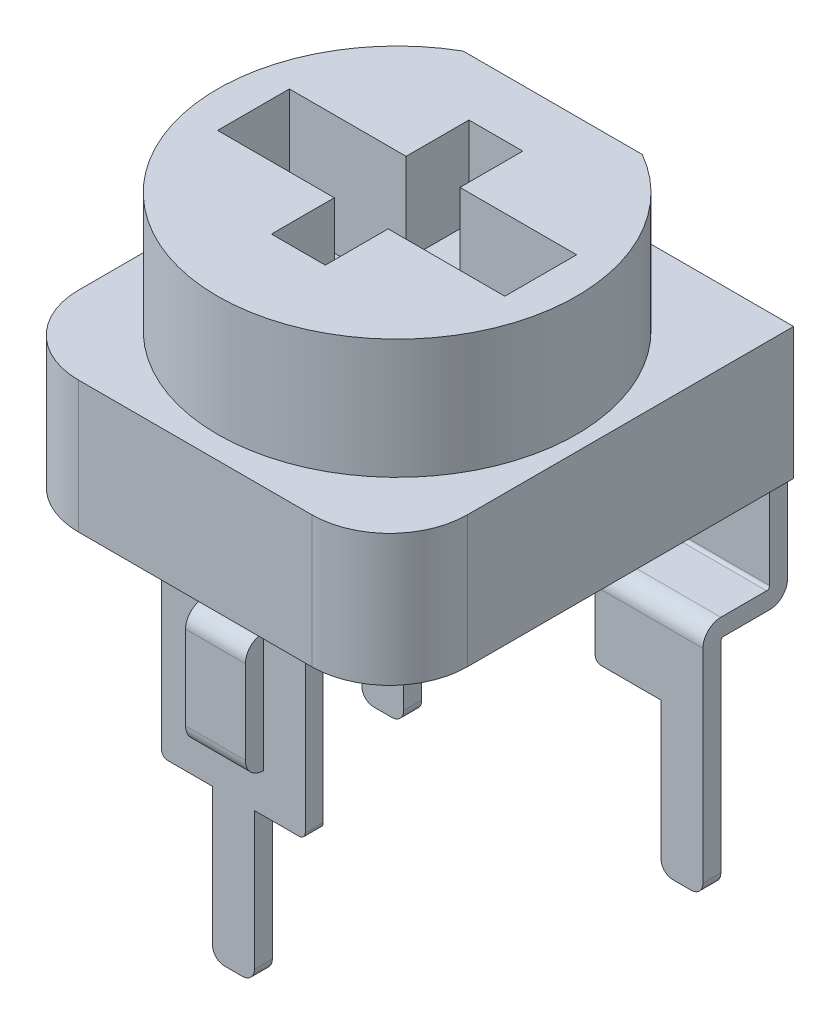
ISO-10303-21;
HEADER;
FILE_DESCRIPTION(('STEP AP214'),'2;1');
FILE_NAME('part.step','',(''),(''),'','','');
FILE_SCHEMA(('AUTOMOTIVE_DESIGN { 1 0 10303 214 1 1 1 1 }'));
ENDSEC;
DATA;
#1=APPLICATION_CONTEXT('core data for automotive mechanical design processes');
#2=APPLICATION_PROTOCOL_DEFINITION('international standard','automotive_design',2000,#1);
#3=PRODUCT_CONTEXT('',#1,'mechanical');
#4=PRODUCT('Part','Part','',(#3));
#5=PRODUCT_RELATED_PRODUCT_CATEGORY('part','',(#4));
#6=PRODUCT_DEFINITION_FORMATION('','',#4);
#7=PRODUCT_DEFINITION_CONTEXT('part definition',#1,'design');
#8=PRODUCT_DEFINITION('design','',#6,#7);
#9=PRODUCT_DEFINITION_SHAPE('','',#8);
#10=(LENGTH_UNIT() NAMED_UNIT(*) SI_UNIT(.MILLI.,.METRE.));
#11=(NAMED_UNIT(*) PLANE_ANGLE_UNIT() SI_UNIT($,.RADIAN.));
#12=(NAMED_UNIT(*) SI_UNIT($,.STERADIAN.) SOLID_ANGLE_UNIT());
#13=UNCERTAINTY_MEASURE_WITH_UNIT(LENGTH_MEASURE(1.E-05),#10,'distance_accuracy_value','');
#14=(GEOMETRIC_REPRESENTATION_CONTEXT(3) GLOBAL_UNCERTAINTY_ASSIGNED_CONTEXT((#13)) GLOBAL_UNIT_ASSIGNED_CONTEXT((#10,
#11,#12)) REPRESENTATION_CONTEXT('',''));
#15=CARTESIAN_POINT('',(0.,0.,0.));
#16=DIRECTION('',(0.,0.,1.));
#17=DIRECTION('',(1.,0.,0.));
#18=AXIS2_PLACEMENT_3D('',#15,#16,#17);
#19=CARTESIAN_POINT('',(0.,-4.3,0.));
#20=DIRECTION('',(0.,1.,0.));
#21=DIRECTION('',(0.,0.,1.));
#22=AXIS2_PLACEMENT_3D('',#19,#20,#21);
#23=PLANE('',#22);
#24=DIRECTION('',(0.,0.,1.));
#25=VECTOR('',#24,1.);
#26=CARTESIAN_POINT('',(-1.05,-4.3,-3.675));
#27=LINE('',#26,#25);
#28=CARTESIAN_POINT('',(-1.05,-4.3,-3.375));
#29=VERTEX_POINT('',#28);
#30=CARTESIAN_POINT('',(-1.05,-4.3,-2.61));
#31=VERTEX_POINT('',#30);
#32=EDGE_CURVE('E233',#29,#31,#27,.T.);
#33=ORIENTED_EDGE('',*,*,#32,.T.);
#34=DIRECTION('',(1.,0.,0.));
#35=VECTOR('',#34,1.);
#36=CARTESIAN_POINT('',(-2.85,-4.3,-2.61));
#37=LINE('',#36,#35);
#38=CARTESIAN_POINT('',(-2.85,-4.3,-2.61));
#39=VERTEX_POINT('',#38);
#40=EDGE_CURVE('E211',#31,#39,#37,.F.);
#41=ORIENTED_EDGE('',*,*,#40,.T.);
#42=DIRECTION('',(0.,0.,-1.));
#43=VECTOR('',#42,1.);
#44=CARTESIAN_POINT('',(-2.85,-4.3,-3.675));
#45=LINE('',#44,#43);
#46=CARTESIAN_POINT('',(-2.85,-4.3,-3.375));
#47=VERTEX_POINT('',#46);
#48=EDGE_CURVE('E243',#39,#47,#45,.T.);
#49=ORIENTED_EDGE('',*,*,#48,.T.);
#50=DIRECTION('',(1.,0.,0.));
#51=VECTOR('',#50,1.);
#52=CARTESIAN_POINT('',(0.,-4.3,-3.375));
#53=LINE('',#52,#51);
#54=EDGE_CURVE('E267',#47,#29,#53,.T.);
#55=ORIENTED_EDGE('',*,*,#54,.T.);
#56=EDGE_LOOP('',(#33,#41,#49,#55));
#57=FACE_BOUND('',#56,.T.);
#58=ADVANCED_FACE('F45',(#57),#23,.F.);
#59=CARTESIAN_POINT('',(-2.85,-0.999999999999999,-3.675));
#60=DIRECTION('',(1.,0.,0.));
#61=DIRECTION('',(0.,1.,0.));
#62=AXIS2_PLACEMENT_3D('',#59,#60,#61);
#63=PLANE('',#62);
#64=DIRECTION('',(0.,1.,0.));
#65=VECTOR('',#64,1.);
#66=CARTESIAN_POINT('',(-2.85,-5.4,-2.56));
#67=LINE('',#66,#65);
#68=CARTESIAN_POINT('',(-2.85,-7.7,-2.56));
#69=VERTEX_POINT('',#68);
#70=CARTESIAN_POINT('',(-2.85,-4.35,-2.56));
#71=VERTEX_POINT('',#70);
#72=EDGE_CURVE('E228',#69,#71,#67,.T.);
#73=ORIENTED_EDGE('',*,*,#72,.F.);
#74=DIRECTION('',(0.,0.,-1.));
#75=VECTOR('',#74,1.);
#76=CARTESIAN_POINT('',(-2.85,-7.7,-3.675));
#77=LINE('',#76,#75);
#78=CARTESIAN_POINT('',(-2.85,-7.7,-2.26));
#79=VERTEX_POINT('',#78);
#80=EDGE_CURVE('E304',#69,#79,#77,.F.);
#81=ORIENTED_EDGE('',*,*,#80,.T.);
#82=DIRECTION('',(0.,1.,0.));
#83=VECTOR('',#82,1.);
#84=CARTESIAN_POINT('',(-2.85,-4.3,-2.26));
#85=LINE('',#84,#83);
#86=CARTESIAN_POINT('',(-2.85,-4.3,-2.26));
#87=VERTEX_POINT('',#86);
#88=EDGE_CURVE('E237',#79,#87,#85,.T.);
#89=ORIENTED_EDGE('',*,*,#88,.T.);
#90=CARTESIAN_POINT('',(-2.85,-4.3,-2.56));
#91=DIRECTION('',(1.,0.,0.));
#92=DIRECTION('',(0.,1.,0.));
#93=AXIS2_PLACEMENT_3D('',#90,#91,#92);
#94=CIRCLE('',#93,0.3);
#95=CARTESIAN_POINT('',(-2.85,-4.,-2.56));
#96=VERTEX_POINT('',#95);
#97=EDGE_CURVE('E221',#87,#96,#94,.F.);
#98=ORIENTED_EDGE('',*,*,#97,.T.);
#99=DIRECTION('',(0.,0.,-1.));
#100=VECTOR('',#99,1.);
#101=CARTESIAN_POINT('',(-2.85,-4.,-3.675));
#102=LINE('',#101,#100);
#103=CARTESIAN_POINT('',(-2.85,-4.,-3.325));
#104=VERTEX_POINT('',#103);
#105=EDGE_CURVE('E224',#96,#104,#102,.T.);
#106=ORIENTED_EDGE('',*,*,#105,.T.);
#107=CARTESIAN_POINT('',(-2.85,-3.95,-3.325));
#108=DIRECTION('',(1.,0.,0.));
#109=DIRECTION('',(0.,1.,0.));
#110=AXIS2_PLACEMENT_3D('',#107,#108,#109);
#111=CIRCLE('',#110,0.05);
#112=CARTESIAN_POINT('',(-2.85,-3.95,-3.375));
#113=VERTEX_POINT('',#112);
#114=EDGE_CURVE('E350',#104,#113,#111,.T.);
#115=ORIENTED_EDGE('',*,*,#114,.T.);
#116=DIRECTION('',(0.,1.,0.));
#117=VECTOR('',#116,1.);
#118=CARTESIAN_POINT('',(-2.85,-0.999999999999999,-3.375));
#119=LINE('',#118,#117);
#120=CARTESIAN_POINT('',(-2.85,-0.999999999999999,-3.375));
#121=VERTEX_POINT('',#120);
#122=EDGE_CURVE('E250',#113,#121,#119,.T.);
#123=ORIENTED_EDGE('',*,*,#122,.T.);
#124=CARTESIAN_POINT('',(-2.85,-1.3,-3.375));
#125=DIRECTION('',(1.,0.,0.));
#126=DIRECTION('',(0.,1.,0.));
#127=AXIS2_PLACEMENT_3D('',#124,#125,#126);
#128=CIRCLE('',#127,0.3);
#129=CARTESIAN_POINT('',(-2.85,-1.3,-3.675));
#130=VERTEX_POINT('',#129);
#131=EDGE_CURVE('E259',#121,#130,#128,.F.);
#132=ORIENTED_EDGE('',*,*,#131,.T.);
#133=DIRECTION('',(0.,1.,0.));
#134=VECTOR('',#133,1.);
#135=CARTESIAN_POINT('',(-2.85,-0.999999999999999,-3.675));
#136=LINE('',#135,#134);
#137=CARTESIAN_POINT('',(-2.85,-4.,-3.675));
#138=VERTEX_POINT('',#137);
#139=EDGE_CURVE('E264',#138,#130,#136,.T.);
#140=ORIENTED_EDGE('',*,*,#139,.F.);
#141=CARTESIAN_POINT('',(-2.85,-4.,-3.375));
#142=DIRECTION('',(1.,0.,0.));
#143=DIRECTION('',(0.,1.,0.));
#144=AXIS2_PLACEMENT_3D('',#141,#142,#143);
#145=CIRCLE('',#144,0.3);
#146=EDGE_CURVE('E244',#138,#47,#145,.F.);
#147=ORIENTED_EDGE('',*,*,#146,.T.);
#148=ORIENTED_EDGE('',*,*,#48,.F.);
#149=CARTESIAN_POINT('',(-2.85,-4.35,-2.61));
#150=DIRECTION('',(1.,0.,0.));
#151=DIRECTION('',(0.,1.,0.));
#152=AXIS2_PLACEMENT_3D('',#149,#150,#151);
#153=CIRCLE('',#152,0.05);
#154=EDGE_CURVE('E205',#39,#71,#153,.T.);
#155=ORIENTED_EDGE('',*,*,#154,.T.);
#156=EDGE_LOOP('',(#73,#81,#89,#98,#106,#115,#123,#132,#140,#147,#148,#155));
#157=FACE_BOUND('',#156,.T.);
#158=ADVANCED_FACE('F282',(#157),#63,.F.);
#159=CARTESIAN_POINT('',(-1.05,-1.,-3.675));
#160=DIRECTION('',(-1.,0.,0.));
#161=DIRECTION('',(0.,0.,1.));
#162=AXIS2_PLACEMENT_3D('',#159,#160,#161);
#163=PLANE('',#162);
#164=DIRECTION('',(0.,1.,0.));
#165=VECTOR('',#164,1.);
#166=CARTESIAN_POINT('',(-1.05,-4.3,-2.26));
#167=LINE('',#166,#165);
#168=CARTESIAN_POINT('',(-1.05,-5.3,-2.26));
#169=VERTEX_POINT('',#168);
#170=CARTESIAN_POINT('',(-1.05,-4.3,-2.26));
#171=VERTEX_POINT('',#170);
#172=EDGE_CURVE('E254',#169,#171,#167,.T.);
#173=ORIENTED_EDGE('',*,*,#172,.F.);
#174=DIRECTION('',(0.,0.,1.));
#175=VECTOR('',#174,1.);
#176=CARTESIAN_POINT('',(-1.05,-5.3,-2.56));
#177=LINE('',#176,#175);
#178=CARTESIAN_POINT('',(-1.05,-5.3,-2.56));
#179=VERTEX_POINT('',#178);
#180=EDGE_CURVE('E53',#169,#179,#177,.F.);
#181=ORIENTED_EDGE('',*,*,#180,.T.);
#182=DIRECTION('',(0.,1.,0.));
#183=VECTOR('',#182,1.);
#184=CARTESIAN_POINT('',(-1.05,-5.4,-2.56));
#185=LINE('',#184,#183);
#186=CARTESIAN_POINT('',(-1.05,-4.35,-2.56));
#187=VERTEX_POINT('',#186);
#188=EDGE_CURVE('E171',#179,#187,#185,.T.);
#189=ORIENTED_EDGE('',*,*,#188,.T.);
#190=CARTESIAN_POINT('',(-1.05,-4.35,-2.61));
#191=DIRECTION('',(-1.,0.,0.));
#192=DIRECTION('',(0.,0.,1.));
#193=AXIS2_PLACEMENT_3D('',#190,#191,#192);
#194=CIRCLE('',#193,0.05);
#195=EDGE_CURVE('E209',#187,#31,#194,.T.);
#196=ORIENTED_EDGE('',*,*,#195,.T.);
#197=ORIENTED_EDGE('',*,*,#32,.F.);
#198=CARTESIAN_POINT('',(-1.05,-4.,-3.375));
#199=DIRECTION('',(-1.,0.,0.));
#200=DIRECTION('',(0.,0.,1.));
#201=AXIS2_PLACEMENT_3D('',#198,#199,#200);
#202=CIRCLE('',#201,0.3);
#203=CARTESIAN_POINT('',(-1.05,-4.,-3.675));
#204=VERTEX_POINT('',#203);
#205=EDGE_CURVE('E270',#29,#204,#202,.F.);
#206=ORIENTED_EDGE('',*,*,#205,.T.);
#207=DIRECTION('',(0.,-1.,0.));
#208=VECTOR('',#207,1.);
#209=CARTESIAN_POINT('',(-1.05,-1.,-3.675));
#210=LINE('',#209,#208);
#211=CARTESIAN_POINT('',(-1.05,-1.3,-3.675));
#212=VERTEX_POINT('',#211);
#213=EDGE_CURVE('E396',#212,#204,#210,.T.);
#214=ORIENTED_EDGE('',*,*,#213,.F.);
#215=CARTESIAN_POINT('',(-1.05,-1.3,-3.375));
#216=DIRECTION('',(-1.,0.,0.));
#217=DIRECTION('',(0.,0.,1.));
#218=AXIS2_PLACEMENT_3D('',#215,#216,#217);
#219=CIRCLE('',#218,0.3);
#220=CARTESIAN_POINT('',(-1.05,-1.,-3.375));
#221=VERTEX_POINT('',#220);
#222=EDGE_CURVE('E395',#212,#221,#219,.F.);
#223=ORIENTED_EDGE('',*,*,#222,.T.);
#224=DIRECTION('',(0.,-1.,0.));
#225=VECTOR('',#224,1.);
#226=CARTESIAN_POINT('',(-1.05,-1.,-3.375));
#227=LINE('',#226,#225);
#228=CARTESIAN_POINT('',(-1.05,-3.95,-3.375));
#229=VERTEX_POINT('',#228);
#230=EDGE_CURVE('E261',#221,#229,#227,.T.);
#231=ORIENTED_EDGE('',*,*,#230,.T.);
#232=CARTESIAN_POINT('',(-1.05,-3.95,-3.325));
#233=DIRECTION('',(-1.,0.,0.));
#234=DIRECTION('',(0.,0.,1.));
#235=AXIS2_PLACEMENT_3D('',#232,#233,#234);
#236=CIRCLE('',#235,0.05);
#237=CARTESIAN_POINT('',(-1.05,-4.,-3.325));
#238=VERTEX_POINT('',#237);
#239=EDGE_CURVE('E346',#229,#238,#236,.T.);
#240=ORIENTED_EDGE('',*,*,#239,.T.);
#241=DIRECTION('',(0.,0.,1.));
#242=VECTOR('',#241,1.);
#243=CARTESIAN_POINT('',(-1.05,-4.,-3.675));
#244=LINE('',#243,#242);
#245=CARTESIAN_POINT('',(-1.05,-4.,-2.56));
#246=VERTEX_POINT('',#245);
#247=EDGE_CURVE('E227',#238,#246,#244,.T.);
#248=ORIENTED_EDGE('',*,*,#247,.T.);
#249=CARTESIAN_POINT('',(-1.05,-4.3,-2.56));
#250=DIRECTION('',(-1.,0.,0.));
#251=DIRECTION('',(0.,0.,1.));
#252=AXIS2_PLACEMENT_3D('',#249,#250,#251);
#253=CIRCLE('',#252,0.3);
#254=EDGE_CURVE('E216',#246,#171,#253,.F.);
#255=ORIENTED_EDGE('',*,*,#254,.T.);
#256=EDGE_LOOP('',(#173,#181,#189,#196,#197,#206,#214,#223,#231,#240,#248,#255));
#257=FACE_BOUND('',#256,.T.);
#258=ADVANCED_FACE('F291',(#257),#163,.F.);
#259=CARTESIAN_POINT('',(0.,0.,-3.675));
#260=DIRECTION('',(0.,0.,1.));
#261=DIRECTION('',(1.,0.,0.));
#262=AXIS2_PLACEMENT_3D('',#259,#260,#261);
#263=PLANE('',#262);
#264=ORIENTED_EDGE('',*,*,#213,.T.);
#265=DIRECTION('',(1.,0.,0.));
#266=VECTOR('',#265,1.);
#267=CARTESIAN_POINT('',(0.,-4.,-3.675));
#268=LINE('',#267,#266);
#269=EDGE_CURVE('E271',#204,#138,#268,.F.);
#270=ORIENTED_EDGE('',*,*,#269,.T.);
#271=ORIENTED_EDGE('',*,*,#139,.T.);
#272=DIRECTION('',(1.,0.,0.));
#273=VECTOR('',#272,1.);
#274=CARTESIAN_POINT('',(0.,-1.3,-3.675));
#275=LINE('',#274,#273);
#276=EDGE_CURVE('E394',#130,#212,#275,.T.);
#277=ORIENTED_EDGE('',*,*,#276,.T.);
#278=EDGE_LOOP('',(#264,#270,#271,#277));
#279=FACE_BOUND('',#278,.T.);
#280=ADVANCED_FACE('F380',(#279),#263,.F.);
#281=CARTESIAN_POINT('',(0.,0.,-3.375));
#282=DIRECTION('',(0.,0.,1.));
#283=DIRECTION('',(1.,0.,0.));
#284=AXIS2_PLACEMENT_3D('',#281,#282,#283);
#285=PLANE('',#284);
#286=ORIENTED_EDGE('',*,*,#122,.F.);
#287=DIRECTION('',(-1.,0.,0.));
#288=VECTOR('',#287,1.);
#289=CARTESIAN_POINT('',(-1.05,-3.95,-3.375));
#290=LINE('',#289,#288);
#291=EDGE_CURVE('E249',#113,#229,#290,.F.);
#292=ORIENTED_EDGE('',*,*,#291,.T.);
#293=ORIENTED_EDGE('',*,*,#230,.F.);
#294=DIRECTION('',(1.,0.,0.));
#295=VECTOR('',#294,1.);
#296=CARTESIAN_POINT('',(-2.85,-0.999999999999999,-3.375));
#297=LINE('',#296,#295);
#298=EDGE_CURVE('E253',#121,#221,#297,.T.);
#299=ORIENTED_EDGE('',*,*,#298,.F.);
#300=EDGE_LOOP('',(#286,#292,#293,#299));
#301=FACE_BOUND('',#300,.T.);
#302=ADVANCED_FACE('F354',(#301),#285,.T.);
#303=CARTESIAN_POINT('',(0.,-1.3,-3.375));
#304=DIRECTION('',(1.,0.,0.));
#305=DIRECTION('',(0.,1.,0.));
#306=AXIS2_PLACEMENT_3D('',#303,#304,#305);
#307=CYLINDRICAL_SURFACE('',#306,0.3);
#308=ORIENTED_EDGE('',*,*,#131,.F.);
#309=ORIENTED_EDGE('',*,*,#298,.T.);
#310=ORIENTED_EDGE('',*,*,#222,.F.);
#311=ORIENTED_EDGE('',*,*,#276,.F.);
#312=EDGE_LOOP('',(#308,#309,#310,#311));
#313=FACE_BOUND('',#312,.T.);
#314=ADVANCED_FACE('F379',(#313),#307,.T.);
#315=CARTESIAN_POINT('',(-2.85,-4.3,-2.26));
#316=DIRECTION('',(0.,0.,-1.));
#317=DIRECTION('',(-1.,0.,0.));
#318=AXIS2_PLACEMENT_3D('',#315,#316,#317);
#319=PLANE('',#318);
#320=DIRECTION('',(-1.,0.,0.));
#321=VECTOR('',#320,1.);
#322=CARTESIAN_POINT('',(-2.85,-5.4,-2.26));
#323=LINE('',#322,#321);
#324=CARTESIAN_POINT('',(-1.15,-5.4,-2.26));
#325=VERTEX_POINT('',#324);
#326=CARTESIAN_POINT('',(-2.15,-5.4,-2.26));
#327=VERTEX_POINT('',#326);
#328=EDGE_CURVE('E162',#325,#327,#323,.T.);
#329=ORIENTED_EDGE('',*,*,#328,.F.);
#330=CARTESIAN_POINT('',(-1.15,-5.3,-2.26));
#331=DIRECTION('',(0.,0.,-1.));
#332=DIRECTION('',(-1.,0.,0.));
#333=AXIS2_PLACEMENT_3D('',#330,#331,#332);
#334=CIRCLE('',#333,0.1);
#335=EDGE_CURVE('E67',#325,#169,#334,.F.);
#336=ORIENTED_EDGE('',*,*,#335,.T.);
#337=ORIENTED_EDGE('',*,*,#172,.T.);
#338=DIRECTION('',(-1.,0.,0.));
#339=VECTOR('',#338,1.);
#340=CARTESIAN_POINT('',(-2.85,-4.3,-2.26));
#341=LINE('',#340,#339);
#342=EDGE_CURVE('E223',#171,#87,#341,.T.);
#343=ORIENTED_EDGE('',*,*,#342,.T.);
#344=ORIENTED_EDGE('',*,*,#88,.F.);
#345=CARTESIAN_POINT('',(-2.65,-7.7,-2.26));
#346=DIRECTION('',(0.,0.,-1.));
#347=DIRECTION('',(-1.,0.,0.));
#348=AXIS2_PLACEMENT_3D('',#345,#346,#347);
#349=CIRCLE('',#348,0.2);
#350=CARTESIAN_POINT('',(-2.65,-7.9,-2.26));
#351=VERTEX_POINT('',#350);
#352=EDGE_CURVE('E311',#79,#351,#349,.F.);
#353=ORIENTED_EDGE('',*,*,#352,.T.);
#354=DIRECTION('',(-1.,0.,0.));
#355=VECTOR('',#354,1.);
#356=CARTESIAN_POINT('',(-2.85,-7.9,-2.26));
#357=LINE('',#356,#355);
#358=CARTESIAN_POINT('',(-2.35,-7.9,-2.26));
#359=VERTEX_POINT('',#358);
#360=EDGE_CURVE('E185',#359,#351,#357,.T.);
#361=ORIENTED_EDGE('',*,*,#360,.F.);
#362=CARTESIAN_POINT('',(-2.35,-7.7,-2.26));
#363=DIRECTION('',(0.,0.,-1.));
#364=DIRECTION('',(-1.,0.,0.));
#365=AXIS2_PLACEMENT_3D('',#362,#363,#364);
#366=CIRCLE('',#365,0.2);
#367=CARTESIAN_POINT('',(-2.15,-7.7,-2.26));
#368=VERTEX_POINT('',#367);
#369=EDGE_CURVE('E178',#359,#368,#366,.F.);
#370=ORIENTED_EDGE('',*,*,#369,.T.);
#371=DIRECTION('',(0.,1.,0.));
#372=VECTOR('',#371,1.);
#373=CARTESIAN_POINT('',(-2.15,-7.9,-2.26));
#374=LINE('',#373,#372);
#375=EDGE_CURVE('E175',#368,#327,#374,.T.);
#376=ORIENTED_EDGE('',*,*,#375,.T.);
#377=EDGE_LOOP('',(#329,#336,#337,#343,#344,#353,#361,#370,#376));
#378=FACE_BOUND('',#377,.T.);
#379=ADVANCED_FACE('F176',(#378),#319,.F.);
#380=CARTESIAN_POINT('',(0.,-4.,0.));
#381=DIRECTION('',(0.,1.,0.));
#382=DIRECTION('',(0.,0.,1.));
#383=AXIS2_PLACEMENT_3D('',#380,#381,#382);
#384=PLANE('',#383);
#385=ORIENTED_EDGE('',*,*,#105,.F.);
#386=DIRECTION('',(-1.,0.,0.));
#387=VECTOR('',#386,1.);
#388=CARTESIAN_POINT('',(-1.05,-4.,-2.56));
#389=LINE('',#388,#387);
#390=EDGE_CURVE('E219',#96,#246,#389,.F.);
#391=ORIENTED_EDGE('',*,*,#390,.T.);
#392=ORIENTED_EDGE('',*,*,#247,.F.);
#393=DIRECTION('',(-1.,0.,0.));
#394=VECTOR('',#393,1.);
#395=CARTESIAN_POINT('',(-2.85,-4.,-3.325));
#396=LINE('',#395,#394);
#397=EDGE_CURVE('E246',#238,#104,#396,.T.);
#398=ORIENTED_EDGE('',*,*,#397,.T.);
#399=EDGE_LOOP('',(#385,#391,#392,#398));
#400=FACE_BOUND('',#399,.T.);
#401=ADVANCED_FACE('F343',(#400),#384,.T.);
#402=CARTESIAN_POINT('',(0.,-4.,-3.375));
#403=DIRECTION('',(1.,0.,0.));
#404=DIRECTION('',(0.,0.,-1.));
#405=AXIS2_PLACEMENT_3D('',#402,#403,#404);
#406=CYLINDRICAL_SURFACE('',#405,0.3);
#407=ORIENTED_EDGE('',*,*,#146,.F.);
#408=ORIENTED_EDGE('',*,*,#269,.F.);
#409=ORIENTED_EDGE('',*,*,#205,.F.);
#410=ORIENTED_EDGE('',*,*,#54,.F.);
#411=EDGE_LOOP('',(#407,#408,#409,#410));
#412=FACE_BOUND('',#411,.T.);
#413=ADVANCED_FACE('F286',(#412),#406,.T.);
#414=CARTESIAN_POINT('',(0.,-3.95,-3.325));
#415=DIRECTION('',(1.,0.,0.));
#416=DIRECTION('',(0.,0.,-1.));
#417=AXIS2_PLACEMENT_3D('',#414,#415,#416);
#418=CYLINDRICAL_SURFACE('',#417,0.05);
#419=ORIENTED_EDGE('',*,*,#239,.F.);
#420=ORIENTED_EDGE('',*,*,#291,.F.);
#421=ORIENTED_EDGE('',*,*,#114,.F.);
#422=ORIENTED_EDGE('',*,*,#397,.F.);
#423=EDGE_LOOP('',(#419,#420,#421,#422));
#424=FACE_BOUND('',#423,.T.);
#425=ADVANCED_FACE('F357',(#424),#418,.F.);
#426=CARTESIAN_POINT('',(-2.85,-5.4,-2.56));
#427=DIRECTION('',(0.,0.,1.));
#428=DIRECTION('',(1.,0.,0.));
#429=AXIS2_PLACEMENT_3D('',#426,#427,#428);
#430=PLANE('',#429);
#431=ORIENTED_EDGE('',*,*,#188,.F.);
#432=CARTESIAN_POINT('',(-1.15,-5.3,-2.56));
#433=DIRECTION('',(0.,0.,1.));
#434=DIRECTION('',(1.,0.,0.));
#435=AXIS2_PLACEMENT_3D('',#432,#433,#434);
#436=CIRCLE('',#435,0.1);
#437=CARTESIAN_POINT('',(-1.15,-5.4,-2.56));
#438=VERTEX_POINT('',#437);
#439=EDGE_CURVE('E12',#179,#438,#436,.F.);
#440=ORIENTED_EDGE('',*,*,#439,.T.);
#441=DIRECTION('',(1.,0.,0.));
#442=VECTOR('',#441,1.);
#443=CARTESIAN_POINT('',(-2.85,-5.4,-2.56));
#444=LINE('',#443,#442);
#445=CARTESIAN_POINT('',(-2.15,-5.4,-2.56));
#446=VERTEX_POINT('',#445);
#447=EDGE_CURVE('E172',#446,#438,#444,.T.);
#448=ORIENTED_EDGE('',*,*,#447,.F.);
#449=DIRECTION('',(0.,1.,0.));
#450=VECTOR('',#449,1.);
#451=CARTESIAN_POINT('',(-2.15,-7.9,-2.56));
#452=LINE('',#451,#450);
#453=CARTESIAN_POINT('',(-2.15,-7.7,-2.56));
#454=VERTEX_POINT('',#453);
#455=EDGE_CURVE('E181',#454,#446,#452,.T.);
#456=ORIENTED_EDGE('',*,*,#455,.F.);
#457=CARTESIAN_POINT('',(-2.35,-7.7,-2.56));
#458=DIRECTION('',(0.,0.,1.));
#459=DIRECTION('',(1.,0.,0.));
#460=AXIS2_PLACEMENT_3D('',#457,#458,#459);
#461=CIRCLE('',#460,0.2);
#462=CARTESIAN_POINT('',(-2.35,-7.9,-2.56));
#463=VERTEX_POINT('',#462);
#464=EDGE_CURVE('E312',#454,#463,#461,.F.);
#465=ORIENTED_EDGE('',*,*,#464,.T.);
#466=DIRECTION('',(1.,0.,0.));
#467=VECTOR('',#466,1.);
#468=CARTESIAN_POINT('',(-2.85,-7.9,-2.56));
#469=LINE('',#468,#467);
#470=CARTESIAN_POINT('',(-2.65,-7.9,-2.56));
#471=VERTEX_POINT('',#470);
#472=EDGE_CURVE('E188',#471,#463,#469,.T.);
#473=ORIENTED_EDGE('',*,*,#472,.F.);
#474=CARTESIAN_POINT('',(-2.65,-7.7,-2.56));
#475=DIRECTION('',(0.,0.,1.));
#476=DIRECTION('',(1.,0.,0.));
#477=AXIS2_PLACEMENT_3D('',#474,#475,#476);
#478=CIRCLE('',#477,0.2);
#479=EDGE_CURVE('E302',#471,#69,#478,.F.);
#480=ORIENTED_EDGE('',*,*,#479,.T.);
#481=ORIENTED_EDGE('',*,*,#72,.T.);
#482=DIRECTION('',(1.,0.,0.));
#483=VECTOR('',#482,1.);
#484=CARTESIAN_POINT('',(-1.05,-4.35,-2.56));
#485=LINE('',#484,#483);
#486=EDGE_CURVE('E213',#71,#187,#485,.T.);
#487=ORIENTED_EDGE('',*,*,#486,.T.);
#488=EDGE_LOOP('',(#431,#440,#448,#456,#465,#473,#480,#481,#487));
#489=FACE_BOUND('',#488,.T.);
#490=ADVANCED_FACE('F300',(#489),#430,.F.);
#491=CARTESIAN_POINT('',(0.,-5.4,0.));
#492=DIRECTION('',(0.,-1.,0.));
#493=DIRECTION('',(0.,0.,-1.));
#494=AXIS2_PLACEMENT_3D('',#491,#492,#493);
#495=PLANE('',#494);
#496=ORIENTED_EDGE('',*,*,#447,.T.);
#497=DIRECTION('',(0.,0.,1.));
#498=VECTOR('',#497,1.);
#499=CARTESIAN_POINT('',(-1.15,-5.4,-2.26));
#500=LINE('',#499,#498);
#501=EDGE_CURVE('E170',#438,#325,#500,.T.);
#502=ORIENTED_EDGE('',*,*,#501,.T.);
#503=ORIENTED_EDGE('',*,*,#328,.T.);
#504=DIRECTION('',(0.,0.,1.));
#505=VECTOR('',#504,1.);
#506=CARTESIAN_POINT('',(-2.15,-5.4,-2.56));
#507=LINE('',#506,#505);
#508=EDGE_CURVE('E167',#446,#327,#507,.T.);
#509=ORIENTED_EDGE('',*,*,#508,.F.);
#510=EDGE_LOOP('',(#496,#502,#503,#509));
#511=FACE_BOUND('',#510,.T.);
#512=ADVANCED_FACE('F165',(#511),#495,.T.);
#513=CARTESIAN_POINT('',(-2.85,-4.3,-2.56));
#514=DIRECTION('',(1.,0.,0.));
#515=DIRECTION('',(0.,0.,-1.));
#516=AXIS2_PLACEMENT_3D('',#513,#514,#515);
#517=CYLINDRICAL_SURFACE('',#516,0.3);
#518=ORIENTED_EDGE('',*,*,#254,.F.);
#519=ORIENTED_EDGE('',*,*,#390,.F.);
#520=ORIENTED_EDGE('',*,*,#97,.F.);
#521=ORIENTED_EDGE('',*,*,#342,.F.);
#522=EDGE_LOOP('',(#518,#519,#520,#521));
#523=FACE_BOUND('',#522,.T.);
#524=ADVANCED_FACE('F340',(#523),#517,.T.);
#525=CARTESIAN_POINT('',(-2.85,-4.35,-2.61));
#526=DIRECTION('',(-1.,0.,0.));
#527=DIRECTION('',(0.,0.,1.));
#528=AXIS2_PLACEMENT_3D('',#525,#526,#527);
#529=CYLINDRICAL_SURFACE('',#528,0.05);
#530=ORIENTED_EDGE('',*,*,#154,.F.);
#531=ORIENTED_EDGE('',*,*,#40,.F.);
#532=ORIENTED_EDGE('',*,*,#195,.F.);
#533=ORIENTED_EDGE('',*,*,#486,.F.);
#534=EDGE_LOOP('',(#530,#531,#532,#533));
#535=FACE_BOUND('',#534,.T.);
#536=ADVANCED_FACE('F299',(#535),#529,.F.);
#537=CARTESIAN_POINT('',(-2.15,-7.9,-2.56));
#538=DIRECTION('',(-1.,0.,0.));
#539=DIRECTION('',(0.,0.,1.));
#540=AXIS2_PLACEMENT_3D('',#537,#538,#539);
#541=PLANE('',#540);
#542=ORIENTED_EDGE('',*,*,#375,.F.);
#543=DIRECTION('',(0.,0.,1.));
#544=VECTOR('',#543,1.);
#545=CARTESIAN_POINT('',(-2.15,-7.7,-2.56));
#546=LINE('',#545,#544);
#547=EDGE_CURVE('E319',#368,#454,#546,.F.);
#548=ORIENTED_EDGE('',*,*,#547,.T.);
#549=ORIENTED_EDGE('',*,*,#455,.T.);
#550=ORIENTED_EDGE('',*,*,#508,.T.);
#551=EDGE_LOOP('',(#542,#548,#549,#550));
#552=FACE_BOUND('',#551,.T.);
#553=ADVANCED_FACE('F183',(#552),#541,.F.);
#554=CARTESIAN_POINT('',(0.,-7.9,0.));
#555=DIRECTION('',(0.,1.,0.));
#556=DIRECTION('',(0.,0.,1.));
#557=AXIS2_PLACEMENT_3D('',#554,#555,#556);
#558=PLANE('',#557);
#559=ORIENTED_EDGE('',*,*,#472,.T.);
#560=DIRECTION('',(0.,0.,1.));
#561=VECTOR('',#560,1.);
#562=CARTESIAN_POINT('',(-2.35,-7.9,0.));
#563=LINE('',#562,#561);
#564=EDGE_CURVE('E323',#463,#359,#563,.T.);
#565=ORIENTED_EDGE('',*,*,#564,.T.);
#566=ORIENTED_EDGE('',*,*,#360,.T.);
#567=DIRECTION('',(0.,0.,-1.));
#568=VECTOR('',#567,1.);
#569=CARTESIAN_POINT('',(-2.65,-7.9,0.));
#570=LINE('',#569,#568);
#571=EDGE_CURVE('E208',#351,#471,#570,.T.);
#572=ORIENTED_EDGE('',*,*,#571,.T.);
#573=EDGE_LOOP('',(#559,#565,#566,#572));
#574=FACE_BOUND('',#573,.T.);
#575=ADVANCED_FACE('F328',(#574),#558,.F.);
#576=CARTESIAN_POINT('',(-2.35,-7.7,0.));
#577=DIRECTION('',(0.,0.,1.));
#578=DIRECTION('',(1.,0.,0.));
#579=AXIS2_PLACEMENT_3D('',#576,#577,#578);
#580=CYLINDRICAL_SURFACE('',#579,0.2);
#581=ORIENTED_EDGE('',*,*,#464,.F.);
#582=ORIENTED_EDGE('',*,*,#547,.F.);
#583=ORIENTED_EDGE('',*,*,#369,.F.);
#584=ORIENTED_EDGE('',*,*,#564,.F.);
#585=EDGE_LOOP('',(#581,#582,#583,#584));
#586=FACE_BOUND('',#585,.T.);
#587=ADVANCED_FACE('F332',(#586),#580,.T.);
#588=CARTESIAN_POINT('',(-2.65,-7.7,0.));
#589=DIRECTION('',(0.,0.,-1.));
#590=DIRECTION('',(-1.,0.,0.));
#591=AXIS2_PLACEMENT_3D('',#588,#589,#590);
#592=CYLINDRICAL_SURFACE('',#591,0.2);
#593=ORIENTED_EDGE('',*,*,#352,.F.);
#594=ORIENTED_EDGE('',*,*,#80,.F.);
#595=ORIENTED_EDGE('',*,*,#479,.F.);
#596=ORIENTED_EDGE('',*,*,#571,.F.);
#597=EDGE_LOOP('',(#593,#594,#595,#596));
#598=FACE_BOUND('',#597,.T.);
#599=ADVANCED_FACE('F308',(#598),#592,.T.);
#600=CARTESIAN_POINT('',(-1.15,-5.3,0.));
#601=DIRECTION('',(0.,0.,-1.));
#602=DIRECTION('',(-1.,0.,0.));
#603=AXIS2_PLACEMENT_3D('',#600,#601,#602);
#604=CYLINDRICAL_SURFACE('',#603,0.1);
#605=ORIENTED_EDGE('',*,*,#439,.F.);
#606=ORIENTED_EDGE('',*,*,#180,.F.);
#607=ORIENTED_EDGE('',*,*,#335,.F.);
#608=ORIENTED_EDGE('',*,*,#501,.F.);
#609=EDGE_LOOP('',(#605,#606,#607,#608));
#610=FACE_BOUND('',#609,.T.);
#611=ADVANCED_FACE('F47',(#610),#604,.T.);
#612=CLOSED_SHELL('',(#58,#158,#258,#280,#302,#314,#379,#401,#413,#425,#490,#512,#524,#536,#553,
#575,#587,#599,#611));
#613=MANIFOLD_SOLID_BREP('B2',#612);
#614=CARTESIAN_POINT('',(0.,-4.3,0.));
#615=DIRECTION('',(0.,1.,0.));
#616=DIRECTION('',(0.,0.,1.));
#617=AXIS2_PLACEMENT_3D('',#614,#615,#616);
#618=PLANE('',#617);
#619=DIRECTION('',(0.,0.,1.));
#620=VECTOR('',#619,1.);
#621=CARTESIAN_POINT('',(2.85,-4.3,-3.675));
#622=LINE('',#621,#620);
#623=CARTESIAN_POINT('',(2.85,-4.3,-3.375));
#624=VERTEX_POINT('',#623);
#625=CARTESIAN_POINT('',(2.85,-4.3,-2.61));
#626=VERTEX_POINT('',#625);
#627=EDGE_CURVE('E776',#624,#626,#622,.T.);
#628=ORIENTED_EDGE('',*,*,#627,.T.);
#629=DIRECTION('',(1.,0.,0.));
#630=VECTOR('',#629,1.);
#631=CARTESIAN_POINT('',(1.05,-4.3,-2.61));
#632=LINE('',#631,#630);
#633=CARTESIAN_POINT('',(1.05,-4.3,-2.61));
#634=VERTEX_POINT('',#633);
#635=EDGE_CURVE('E752',#626,#634,#632,.F.);
#636=ORIENTED_EDGE('',*,*,#635,.T.);
#637=DIRECTION('',(0.,0.,-1.));
#638=VECTOR('',#637,1.);
#639=CARTESIAN_POINT('',(1.05,-4.3,-3.675));
#640=LINE('',#639,#638);
#641=CARTESIAN_POINT('',(1.05,-4.3,-3.375));
#642=VERTEX_POINT('',#641);
#643=EDGE_CURVE('E786',#634,#642,#640,.T.);
#644=ORIENTED_EDGE('',*,*,#643,.T.);
#645=DIRECTION('',(1.,0.,0.));
#646=VECTOR('',#645,1.);
#647=CARTESIAN_POINT('',(2.85,-4.3,-3.375));
#648=LINE('',#647,#646);
#649=EDGE_CURVE('E810',#642,#624,#648,.T.);
#650=ORIENTED_EDGE('',*,*,#649,.T.);
#651=EDGE_LOOP('',(#628,#636,#644,#650));
#652=FACE_BOUND('',#651,.T.);
#653=ADVANCED_FACE('F561',(#652),#618,.F.);
#654=CARTESIAN_POINT('',(1.05,-1.,-3.675));
#655=DIRECTION('',(1.,0.,0.));
#656=DIRECTION('',(0.,1.,0.));
#657=AXIS2_PLACEMENT_3D('',#654,#655,#656);
#658=PLANE('',#657);
#659=DIRECTION('',(0.,1.,0.));
#660=VECTOR('',#659,1.);
#661=CARTESIAN_POINT('',(1.05,-5.4,-2.56));
#662=LINE('',#661,#660);
#663=CARTESIAN_POINT('',(1.05,-5.3,-2.56));
#664=VERTEX_POINT('',#663);
#665=CARTESIAN_POINT('',(1.05,-4.35,-2.56));
#666=VERTEX_POINT('',#665);
#667=EDGE_CURVE('E771',#664,#666,#662,.T.);
#668=ORIENTED_EDGE('',*,*,#667,.F.);
#669=DIRECTION('',(0.,0.,-1.));
#670=VECTOR('',#669,1.);
#671=CARTESIAN_POINT('',(1.05,-5.3,-2.26));
#672=LINE('',#671,#670);
#673=CARTESIAN_POINT('',(1.05,-5.3,-2.26));
#674=VERTEX_POINT('',#673);
#675=EDGE_CURVE('E569',#664,#674,#672,.F.);
#676=ORIENTED_EDGE('',*,*,#675,.T.);
#677=DIRECTION('',(0.,1.,0.));
#678=VECTOR('',#677,1.);
#679=CARTESIAN_POINT('',(1.05,-4.3,-2.26));
#680=LINE('',#679,#678);
#681=CARTESIAN_POINT('',(1.05,-4.3,-2.26));
#682=VERTEX_POINT('',#681);
#683=EDGE_CURVE('E780',#674,#682,#680,.T.);
#684=ORIENTED_EDGE('',*,*,#683,.T.);
#685=CARTESIAN_POINT('',(1.05,-4.3,-2.56));
#686=DIRECTION('',(1.,0.,0.));
#687=DIRECTION('',(0.,1.,0.));
#688=AXIS2_PLACEMENT_3D('',#685,#686,#687);
#689=CIRCLE('',#688,0.3);
#690=CARTESIAN_POINT('',(1.05,-4.,-2.56));
#691=VERTEX_POINT('',#690);
#692=EDGE_CURVE('E764',#682,#691,#689,.F.);
#693=ORIENTED_EDGE('',*,*,#692,.T.);
#694=DIRECTION('',(0.,0.,-1.));
#695=VECTOR('',#694,1.);
#696=CARTESIAN_POINT('',(1.05,-4.,-3.675));
#697=LINE('',#696,#695);
#698=CARTESIAN_POINT('',(1.05,-4.,-3.325));
#699=VERTEX_POINT('',#698);
#700=EDGE_CURVE('E767',#691,#699,#697,.T.);
#701=ORIENTED_EDGE('',*,*,#700,.T.);
#702=CARTESIAN_POINT('',(1.05,-3.95,-3.325));
#703=DIRECTION('',(1.,0.,0.));
#704=DIRECTION('',(0.,1.,0.));
#705=AXIS2_PLACEMENT_3D('',#702,#703,#704);
#706=CIRCLE('',#705,0.05);
#707=CARTESIAN_POINT('',(1.05,-3.95,-3.375));
#708=VERTEX_POINT('',#707);
#709=EDGE_CURVE('E894',#699,#708,#706,.T.);
#710=ORIENTED_EDGE('',*,*,#709,.T.);
#711=DIRECTION('',(0.,1.,0.));
#712=VECTOR('',#711,1.);
#713=CARTESIAN_POINT('',(1.05,-1.,-3.375));
#714=LINE('',#713,#712);
#715=CARTESIAN_POINT('',(1.05,-1.,-3.375));
#716=VERTEX_POINT('',#715);
#717=EDGE_CURVE('E793',#708,#716,#714,.T.);
#718=ORIENTED_EDGE('',*,*,#717,.T.);
#719=CARTESIAN_POINT('',(1.05,-1.3,-3.375));
#720=DIRECTION('',(1.,0.,0.));
#721=DIRECTION('',(0.,1.,0.));
#722=AXIS2_PLACEMENT_3D('',#719,#720,#721);
#723=CIRCLE('',#722,0.3);
#724=CARTESIAN_POINT('',(1.05,-1.3,-3.675));
#725=VERTEX_POINT('',#724);
#726=EDGE_CURVE('E802',#716,#725,#723,.F.);
#727=ORIENTED_EDGE('',*,*,#726,.T.);
#728=DIRECTION('',(0.,1.,0.));
#729=VECTOR('',#728,1.);
#730=CARTESIAN_POINT('',(1.05,-1.,-3.675));
#731=LINE('',#730,#729);
#732=CARTESIAN_POINT('',(1.05,-4.,-3.675));
#733=VERTEX_POINT('',#732);
#734=EDGE_CURVE('E807',#733,#725,#731,.T.);
#735=ORIENTED_EDGE('',*,*,#734,.F.);
#736=CARTESIAN_POINT('',(1.05,-4.,-3.375));
#737=DIRECTION('',(1.,0.,0.));
#738=DIRECTION('',(0.,1.,0.));
#739=AXIS2_PLACEMENT_3D('',#736,#737,#738);
#740=CIRCLE('',#739,0.3);
#741=EDGE_CURVE('E787',#733,#642,#740,.F.);
#742=ORIENTED_EDGE('',*,*,#741,.T.);
#743=ORIENTED_EDGE('',*,*,#643,.F.);
#744=CARTESIAN_POINT('',(1.05,-4.35,-2.61));
#745=DIRECTION('',(1.,0.,0.));
#746=DIRECTION('',(0.,1.,0.));
#747=AXIS2_PLACEMENT_3D('',#744,#745,#746);
#748=CIRCLE('',#747,0.05);
#749=EDGE_CURVE('E743',#634,#666,#748,.T.);
#750=ORIENTED_EDGE('',*,*,#749,.T.);
#751=EDGE_LOOP('',(#668,#676,#684,#693,#701,#710,#718,#727,#735,#742,#743,#750));
#752=FACE_BOUND('',#751,.T.);
#753=ADVANCED_FACE('F822',(#752),#658,.F.);
#754=CARTESIAN_POINT('',(2.85,-1.,-3.675));
#755=DIRECTION('',(-1.,0.,0.));
#756=DIRECTION('',(0.,-1.,0.));
#757=AXIS2_PLACEMENT_3D('',#754,#755,#756);
#758=PLANE('',#757);
#759=DIRECTION('',(0.,1.,0.));
#760=VECTOR('',#759,1.);
#761=CARTESIAN_POINT('',(2.85,-4.3,-2.26));
#762=LINE('',#761,#760);
#763=CARTESIAN_POINT('',(2.85,-7.7,-2.26));
#764=VERTEX_POINT('',#763);
#765=CARTESIAN_POINT('',(2.85,-4.3,-2.26));
#766=VERTEX_POINT('',#765);
#767=EDGE_CURVE('E797',#764,#766,#762,.T.);
#768=ORIENTED_EDGE('',*,*,#767,.F.);
#769=DIRECTION('',(0.,0.,1.));
#770=VECTOR('',#769,1.);
#771=CARTESIAN_POINT('',(2.85,-7.7,-3.675));
#772=LINE('',#771,#770);
#773=CARTESIAN_POINT('',(2.85,-7.7,-2.56));
#774=VERTEX_POINT('',#773);
#775=EDGE_CURVE('E729',#764,#774,#772,.F.);
#776=ORIENTED_EDGE('',*,*,#775,.T.);
#777=DIRECTION('',(0.,1.,0.));
#778=VECTOR('',#777,1.);
#779=CARTESIAN_POINT('',(2.85,-5.4,-2.56));
#780=LINE('',#779,#778);
#781=CARTESIAN_POINT('',(2.85,-4.35,-2.56));
#782=VERTEX_POINT('',#781);
#783=EDGE_CURVE('E687',#774,#782,#780,.T.);
#784=ORIENTED_EDGE('',*,*,#783,.T.);
#785=CARTESIAN_POINT('',(2.85,-4.35,-2.61));
#786=DIRECTION('',(-1.,0.,0.));
#787=DIRECTION('',(0.,-1.,0.));
#788=AXIS2_PLACEMENT_3D('',#785,#786,#787);
#789=CIRCLE('',#788,0.05);
#790=EDGE_CURVE('E748',#782,#626,#789,.T.);
#791=ORIENTED_EDGE('',*,*,#790,.T.);
#792=ORIENTED_EDGE('',*,*,#627,.F.);
#793=CARTESIAN_POINT('',(2.85,-4.,-3.375));
#794=DIRECTION('',(-1.,0.,0.));
#795=DIRECTION('',(0.,-1.,0.));
#796=AXIS2_PLACEMENT_3D('',#793,#794,#795);
#797=CIRCLE('',#796,0.3);
#798=CARTESIAN_POINT('',(2.85,-4.,-3.675));
#799=VERTEX_POINT('',#798);
#800=EDGE_CURVE('E813',#624,#799,#797,.F.);
#801=ORIENTED_EDGE('',*,*,#800,.T.);
#802=DIRECTION('',(0.,-1.,0.));
#803=VECTOR('',#802,1.);
#804=CARTESIAN_POINT('',(2.85,-1.,-3.675));
#805=LINE('',#804,#803);
#806=CARTESIAN_POINT('',(2.85,-1.3,-3.675));
#807=VERTEX_POINT('',#806);
#808=EDGE_CURVE('E901',#807,#799,#805,.T.);
#809=ORIENTED_EDGE('',*,*,#808,.F.);
#810=CARTESIAN_POINT('',(2.85,-1.3,-3.375));
#811=DIRECTION('',(-1.,0.,0.));
#812=DIRECTION('',(0.,-1.,0.));
#813=AXIS2_PLACEMENT_3D('',#810,#811,#812);
#814=CIRCLE('',#813,0.3);
#815=CARTESIAN_POINT('',(2.85,-1.,-3.375));
#816=VERTEX_POINT('',#815);
#817=EDGE_CURVE('E900',#807,#816,#814,.F.);
#818=ORIENTED_EDGE('',*,*,#817,.T.);
#819=DIRECTION('',(0.,-1.,0.));
#820=VECTOR('',#819,1.);
#821=CARTESIAN_POINT('',(2.85,-1.,-3.375));
#822=LINE('',#821,#820);
#823=CARTESIAN_POINT('',(2.85,-3.95,-3.375));
#824=VERTEX_POINT('',#823);
#825=EDGE_CURVE('E804',#816,#824,#822,.T.);
#826=ORIENTED_EDGE('',*,*,#825,.T.);
#827=CARTESIAN_POINT('',(2.85,-3.95,-3.325));
#828=DIRECTION('',(-1.,0.,0.));
#829=DIRECTION('',(0.,-1.,0.));
#830=AXIS2_PLACEMENT_3D('',#827,#828,#829);
#831=CIRCLE('',#830,0.05);
#832=CARTESIAN_POINT('',(2.85,-4.,-3.325));
#833=VERTEX_POINT('',#832);
#834=EDGE_CURVE('E891',#824,#833,#831,.T.);
#835=ORIENTED_EDGE('',*,*,#834,.T.);
#836=DIRECTION('',(0.,0.,1.));
#837=VECTOR('',#836,1.);
#838=CARTESIAN_POINT('',(2.85,-4.,-3.675));
#839=LINE('',#838,#837);
#840=CARTESIAN_POINT('',(2.85,-4.,-2.56));
#841=VERTEX_POINT('',#840);
#842=EDGE_CURVE('E770',#833,#841,#839,.T.);
#843=ORIENTED_EDGE('',*,*,#842,.T.);
#844=CARTESIAN_POINT('',(2.85,-4.3,-2.56));
#845=DIRECTION('',(-1.,0.,0.));
#846=DIRECTION('',(0.,-1.,0.));
#847=AXIS2_PLACEMENT_3D('',#844,#845,#846);
#848=CIRCLE('',#847,0.3);
#849=EDGE_CURVE('E759',#841,#766,#848,.F.);
#850=ORIENTED_EDGE('',*,*,#849,.T.);
#851=EDGE_LOOP('',(#768,#776,#784,#791,#792,#801,#809,#818,#826,#835,#843,#850));
#852=FACE_BOUND('',#851,.T.);
#853=ADVANCED_FACE('F832',(#852),#758,.F.);
#854=CARTESIAN_POINT('',(0.,0.,-3.675));
#855=DIRECTION('',(0.,0.,-1.));
#856=DIRECTION('',(-1.,0.,0.));
#857=AXIS2_PLACEMENT_3D('',#854,#855,#856);
#858=PLANE('',#857);
#859=ORIENTED_EDGE('',*,*,#808,.T.);
#860=DIRECTION('',(1.,0.,0.));
#861=VECTOR('',#860,1.);
#862=CARTESIAN_POINT('',(1.05,-4.,-3.675));
#863=LINE('',#862,#861);
#864=EDGE_CURVE('E814',#799,#733,#863,.F.);
#865=ORIENTED_EDGE('',*,*,#864,.T.);
#866=ORIENTED_EDGE('',*,*,#734,.T.);
#867=DIRECTION('',(1.,0.,0.));
#868=VECTOR('',#867,1.);
#869=CARTESIAN_POINT('',(2.85,-1.3,-3.675));
#870=LINE('',#869,#868);
#871=EDGE_CURVE('E904',#725,#807,#870,.T.);
#872=ORIENTED_EDGE('',*,*,#871,.T.);
#873=EDGE_LOOP('',(#859,#865,#866,#872));
#874=FACE_BOUND('',#873,.T.);
#875=ADVANCED_FACE('F868',(#874),#858,.T.);
#876=CARTESIAN_POINT('',(0.,0.,-3.375));
#877=DIRECTION('',(0.,0.,-1.));
#878=DIRECTION('',(-1.,0.,0.));
#879=AXIS2_PLACEMENT_3D('',#876,#877,#878);
#880=PLANE('',#879);
#881=ORIENTED_EDGE('',*,*,#717,.F.);
#882=DIRECTION('',(-1.,0.,0.));
#883=VECTOR('',#882,1.);
#884=CARTESIAN_POINT('',(0.,-3.95,-3.375));
#885=LINE('',#884,#883);
#886=EDGE_CURVE('E792',#708,#824,#885,.F.);
#887=ORIENTED_EDGE('',*,*,#886,.T.);
#888=ORIENTED_EDGE('',*,*,#825,.F.);
#889=DIRECTION('',(1.,0.,0.));
#890=VECTOR('',#889,1.);
#891=CARTESIAN_POINT('',(2.85,-1.,-3.375));
#892=LINE('',#891,#890);
#893=EDGE_CURVE('E796',#716,#816,#892,.T.);
#894=ORIENTED_EDGE('',*,*,#893,.F.);
#895=EDGE_LOOP('',(#881,#887,#888,#894));
#896=FACE_BOUND('',#895,.T.);
#897=ADVANCED_FACE('F871',(#896),#880,.F.);
#898=CARTESIAN_POINT('',(0.,-1.3,-3.375));
#899=DIRECTION('',(-1.,0.,0.));
#900=DIRECTION('',(0.,0.,1.));
#901=AXIS2_PLACEMENT_3D('',#898,#899,#900);
#902=CYLINDRICAL_SURFACE('',#901,0.3);
#903=ORIENTED_EDGE('',*,*,#726,.F.);
#904=ORIENTED_EDGE('',*,*,#893,.T.);
#905=ORIENTED_EDGE('',*,*,#817,.F.);
#906=ORIENTED_EDGE('',*,*,#871,.F.);
#907=EDGE_LOOP('',(#903,#904,#905,#906));
#908=FACE_BOUND('',#907,.T.);
#909=ADVANCED_FACE('F866',(#908),#902,.T.);
#910=CARTESIAN_POINT('',(1.05,-4.3,-2.26));
#911=DIRECTION('',(0.,0.,-1.));
#912=DIRECTION('',(-1.,0.,0.));
#913=AXIS2_PLACEMENT_3D('',#910,#911,#912);
#914=PLANE('',#913);
#915=ORIENTED_EDGE('',*,*,#683,.F.);
#916=CARTESIAN_POINT('',(1.15,-5.3,-2.26));
#917=DIRECTION('',(0.,0.,-1.));
#918=DIRECTION('',(-1.,0.,0.));
#919=AXIS2_PLACEMENT_3D('',#916,#917,#918);
#920=CIRCLE('',#919,0.1);
#921=CARTESIAN_POINT('',(1.15,-5.4,-2.26));
#922=VERTEX_POINT('',#921);
#923=EDGE_CURVE('E43',#674,#922,#920,.F.);
#924=ORIENTED_EDGE('',*,*,#923,.T.);
#925=DIRECTION('',(-1.,0.,0.));
#926=VECTOR('',#925,1.);
#927=CARTESIAN_POINT('',(2.85,-5.4,-2.26));
#928=LINE('',#927,#926);
#929=CARTESIAN_POINT('',(2.15,-5.4,-2.26));
#930=VERTEX_POINT('',#929);
#931=EDGE_CURVE('E688',#930,#922,#928,.T.);
#932=ORIENTED_EDGE('',*,*,#931,.F.);
#933=DIRECTION('',(0.,1.,0.));
#934=VECTOR('',#933,1.);
#935=CARTESIAN_POINT('',(2.15,-7.9,-2.26));
#936=LINE('',#935,#934);
#937=CARTESIAN_POINT('',(2.15,-7.7,-2.26));
#938=VERTEX_POINT('',#937);
#939=EDGE_CURVE('E697',#938,#930,#936,.T.);
#940=ORIENTED_EDGE('',*,*,#939,.F.);
#941=CARTESIAN_POINT('',(2.35,-7.7,-2.26));
#942=DIRECTION('',(0.,0.,-1.));
#943=DIRECTION('',(-1.,0.,0.));
#944=AXIS2_PLACEMENT_3D('',#941,#942,#943);
#945=CIRCLE('',#944,0.2);
#946=CARTESIAN_POINT('',(2.35,-7.9,-2.26));
#947=VERTEX_POINT('',#946);
#948=EDGE_CURVE('E735',#938,#947,#945,.F.);
#949=ORIENTED_EDGE('',*,*,#948,.T.);
#950=DIRECTION('',(-1.,0.,0.));
#951=VECTOR('',#950,1.);
#952=CARTESIAN_POINT('',(2.15,-7.9,-2.26));
#953=LINE('',#952,#951);
#954=CARTESIAN_POINT('',(2.65,-7.9,-2.26));
#955=VERTEX_POINT('',#954);
#956=EDGE_CURVE('E702',#955,#947,#953,.T.);
#957=ORIENTED_EDGE('',*,*,#956,.F.);
#958=CARTESIAN_POINT('',(2.65,-7.7,-2.26));
#959=DIRECTION('',(0.,0.,-1.));
#960=DIRECTION('',(-1.,0.,0.));
#961=AXIS2_PLACEMENT_3D('',#958,#959,#960);
#962=CIRCLE('',#961,0.2);
#963=EDGE_CURVE('E733',#955,#764,#962,.F.);
#964=ORIENTED_EDGE('',*,*,#963,.T.);
#965=ORIENTED_EDGE('',*,*,#767,.T.);
#966=DIRECTION('',(-1.,0.,0.));
#967=VECTOR('',#966,1.);
#968=CARTESIAN_POINT('',(1.05,-4.3,-2.26));
#969=LINE('',#968,#967);
#970=EDGE_CURVE('E766',#766,#682,#969,.T.);
#971=ORIENTED_EDGE('',*,*,#970,.T.);
#972=EDGE_LOOP('',(#915,#924,#932,#940,#949,#957,#964,#965,#971));
#973=FACE_BOUND('',#972,.T.);
#974=ADVANCED_FACE('F862',(#973),#914,.F.);
#975=CARTESIAN_POINT('',(0.,-4.,0.));
#976=DIRECTION('',(0.,1.,0.));
#977=DIRECTION('',(0.,0.,1.));
#978=AXIS2_PLACEMENT_3D('',#975,#976,#977);
#979=PLANE('',#978);
#980=ORIENTED_EDGE('',*,*,#700,.F.);
#981=DIRECTION('',(-1.,0.,0.));
#982=VECTOR('',#981,1.);
#983=CARTESIAN_POINT('',(2.85,-4.,-2.56));
#984=LINE('',#983,#982);
#985=EDGE_CURVE('E762',#691,#841,#984,.F.);
#986=ORIENTED_EDGE('',*,*,#985,.T.);
#987=ORIENTED_EDGE('',*,*,#842,.F.);
#988=DIRECTION('',(-1.,0.,0.));
#989=VECTOR('',#988,1.);
#990=CARTESIAN_POINT('',(0.,-4.,-3.325));
#991=LINE('',#990,#989);
#992=EDGE_CURVE('E789',#833,#699,#991,.T.);
#993=ORIENTED_EDGE('',*,*,#992,.T.);
#994=EDGE_LOOP('',(#980,#986,#987,#993));
#995=FACE_BOUND('',#994,.T.);
#996=ADVANCED_FACE('F859',(#995),#979,.T.);
#997=CARTESIAN_POINT('',(0.,-4.,-3.375));
#998=DIRECTION('',(-1.,0.,0.));
#999=DIRECTION('',(0.,0.,1.));
#1000=AXIS2_PLACEMENT_3D('',#997,#998,#999);
#1001=CYLINDRICAL_SURFACE('',#1000,0.3);
#1002=ORIENTED_EDGE('',*,*,#741,.F.);
#1003=ORIENTED_EDGE('',*,*,#864,.F.);
#1004=ORIENTED_EDGE('',*,*,#800,.F.);
#1005=ORIENTED_EDGE('',*,*,#649,.F.);
#1006=EDGE_LOOP('',(#1002,#1003,#1004,#1005));
#1007=FACE_BOUND('',#1006,.T.);
#1008=ADVANCED_FACE('F825',(#1007),#1001,.T.);
#1009=CARTESIAN_POINT('',(0.,-3.95,-3.325));
#1010=DIRECTION('',(-1.,0.,0.));
#1011=DIRECTION('',(0.,0.,1.));
#1012=AXIS2_PLACEMENT_3D('',#1009,#1010,#1011);
#1013=CYLINDRICAL_SURFACE('',#1012,0.05);
#1014=ORIENTED_EDGE('',*,*,#834,.F.);
#1015=ORIENTED_EDGE('',*,*,#886,.F.);
#1016=ORIENTED_EDGE('',*,*,#709,.F.);
#1017=ORIENTED_EDGE('',*,*,#992,.F.);
#1018=EDGE_LOOP('',(#1014,#1015,#1016,#1017));
#1019=FACE_BOUND('',#1018,.T.);
#1020=ADVANCED_FACE('F882',(#1019),#1013,.F.);
#1021=CARTESIAN_POINT('',(2.85,-5.4,-2.56));
#1022=DIRECTION('',(0.,0.,1.));
#1023=DIRECTION('',(1.,0.,0.));
#1024=AXIS2_PLACEMENT_3D('',#1021,#1022,#1023);
#1025=PLANE('',#1024);
#1026=DIRECTION('',(1.,0.,0.));
#1027=VECTOR('',#1026,1.);
#1028=CARTESIAN_POINT('',(2.85,-5.4,-2.56));
#1029=LINE('',#1028,#1027);
#1030=CARTESIAN_POINT('',(1.15,-5.4,-2.56));
#1031=VERTEX_POINT('',#1030);
#1032=CARTESIAN_POINT('',(2.15,-5.4,-2.56));
#1033=VERTEX_POINT('',#1032);
#1034=EDGE_CURVE('E678',#1031,#1033,#1029,.T.);
#1035=ORIENTED_EDGE('',*,*,#1034,.F.);
#1036=CARTESIAN_POINT('',(1.15,-5.3,-2.56));
#1037=DIRECTION('',(0.,0.,1.));
#1038=DIRECTION('',(1.,0.,0.));
#1039=AXIS2_PLACEMENT_3D('',#1036,#1037,#1038);
#1040=CIRCLE('',#1039,0.1);
#1041=EDGE_CURVE('E583',#1031,#664,#1040,.F.);
#1042=ORIENTED_EDGE('',*,*,#1041,.T.);
#1043=ORIENTED_EDGE('',*,*,#667,.T.);
#1044=DIRECTION('',(1.,0.,0.));
#1045=VECTOR('',#1044,1.);
#1046=CARTESIAN_POINT('',(2.85,-4.35,-2.56));
#1047=LINE('',#1046,#1045);
#1048=EDGE_CURVE('E756',#666,#782,#1047,.T.);
#1049=ORIENTED_EDGE('',*,*,#1048,.T.);
#1050=ORIENTED_EDGE('',*,*,#783,.F.);
#1051=CARTESIAN_POINT('',(2.65,-7.7,-2.56));
#1052=DIRECTION('',(0.,0.,1.));
#1053=DIRECTION('',(1.,0.,0.));
#1054=AXIS2_PLACEMENT_3D('',#1051,#1052,#1053);
#1055=CIRCLE('',#1054,0.2);
#1056=CARTESIAN_POINT('',(2.65,-7.9,-2.56));
#1057=VERTEX_POINT('',#1056);
#1058=EDGE_CURVE('E725',#774,#1057,#1055,.F.);
#1059=ORIENTED_EDGE('',*,*,#1058,.T.);
#1060=DIRECTION('',(1.,0.,0.));
#1061=VECTOR('',#1060,1.);
#1062=CARTESIAN_POINT('',(2.15,-7.9,-2.56));
#1063=LINE('',#1062,#1061);
#1064=CARTESIAN_POINT('',(2.35,-7.9,-2.56));
#1065=VERTEX_POINT('',#1064);
#1066=EDGE_CURVE('E698',#1065,#1057,#1063,.T.);
#1067=ORIENTED_EDGE('',*,*,#1066,.F.);
#1068=CARTESIAN_POINT('',(2.35,-7.7,-2.56));
#1069=DIRECTION('',(0.,0.,1.));
#1070=DIRECTION('',(1.,0.,0.));
#1071=AXIS2_PLACEMENT_3D('',#1068,#1069,#1070);
#1072=CIRCLE('',#1071,0.2);
#1073=CARTESIAN_POINT('',(2.15,-7.7,-2.56));
#1074=VERTEX_POINT('',#1073);
#1075=EDGE_CURVE('E694',#1065,#1074,#1072,.F.);
#1076=ORIENTED_EDGE('',*,*,#1075,.T.);
#1077=DIRECTION('',(0.,1.,0.));
#1078=VECTOR('',#1077,1.);
#1079=CARTESIAN_POINT('',(2.15,-7.9,-2.56));
#1080=LINE('',#1079,#1078);
#1081=EDGE_CURVE('E691',#1074,#1033,#1080,.T.);
#1082=ORIENTED_EDGE('',*,*,#1081,.T.);
#1083=EDGE_LOOP('',(#1035,#1042,#1043,#1049,#1050,#1059,#1067,#1076,#1082));
#1084=FACE_BOUND('',#1083,.T.);
#1085=ADVANCED_FACE('F692',(#1084),#1025,.F.);
#1086=CARTESIAN_POINT('',(0.,-5.4,0.));
#1087=DIRECTION('',(0.,-1.,0.));
#1088=DIRECTION('',(0.,0.,-1.));
#1089=AXIS2_PLACEMENT_3D('',#1086,#1087,#1088);
#1090=PLANE('',#1089);
#1091=ORIENTED_EDGE('',*,*,#931,.T.);
#1092=DIRECTION('',(0.,0.,-1.));
#1093=VECTOR('',#1092,1.);
#1094=CARTESIAN_POINT('',(1.15,-5.4,-2.56));
#1095=LINE('',#1094,#1093);
#1096=EDGE_CURVE('E686',#922,#1031,#1095,.T.);
#1097=ORIENTED_EDGE('',*,*,#1096,.T.);
#1098=ORIENTED_EDGE('',*,*,#1034,.T.);
#1099=DIRECTION('',(0.,0.,-1.));
#1100=VECTOR('',#1099,1.);
#1101=CARTESIAN_POINT('',(2.15,-5.4,-2.56));
#1102=LINE('',#1101,#1100);
#1103=EDGE_CURVE('E683',#930,#1033,#1102,.T.);
#1104=ORIENTED_EDGE('',*,*,#1103,.F.);
#1105=EDGE_LOOP('',(#1091,#1097,#1098,#1104));
#1106=FACE_BOUND('',#1105,.T.);
#1107=ADVANCED_FACE('F681',(#1106),#1090,.T.);
#1108=CARTESIAN_POINT('',(1.05,-4.3,-2.56));
#1109=DIRECTION('',(1.,0.,0.));
#1110=DIRECTION('',(0.,0.,-1.));
#1111=AXIS2_PLACEMENT_3D('',#1108,#1109,#1110);
#1112=CYLINDRICAL_SURFACE('',#1111,0.3);
#1113=ORIENTED_EDGE('',*,*,#849,.F.);
#1114=ORIENTED_EDGE('',*,*,#985,.F.);
#1115=ORIENTED_EDGE('',*,*,#692,.F.);
#1116=ORIENTED_EDGE('',*,*,#970,.F.);
#1117=EDGE_LOOP('',(#1113,#1114,#1115,#1116));
#1118=FACE_BOUND('',#1117,.T.);
#1119=ADVANCED_FACE('F839',(#1118),#1112,.T.);
#1120=CARTESIAN_POINT('',(2.85,-4.35,-2.61));
#1121=DIRECTION('',(-1.,0.,0.));
#1122=DIRECTION('',(0.,0.,1.));
#1123=AXIS2_PLACEMENT_3D('',#1120,#1121,#1122);
#1124=CYLINDRICAL_SURFACE('',#1123,0.05);
#1125=ORIENTED_EDGE('',*,*,#749,.F.);
#1126=ORIENTED_EDGE('',*,*,#635,.F.);
#1127=ORIENTED_EDGE('',*,*,#790,.F.);
#1128=ORIENTED_EDGE('',*,*,#1048,.F.);
#1129=EDGE_LOOP('',(#1125,#1126,#1127,#1128));
#1130=FACE_BOUND('',#1129,.T.);
#1131=ADVANCED_FACE('F837',(#1130),#1124,.F.);
#1132=CARTESIAN_POINT('',(2.15,-7.9,-2.56));
#1133=DIRECTION('',(1.,0.,0.));
#1134=DIRECTION('',(0.,0.,-1.));
#1135=AXIS2_PLACEMENT_3D('',#1132,#1133,#1134);
#1136=PLANE('',#1135);
#1137=ORIENTED_EDGE('',*,*,#1081,.F.);
#1138=DIRECTION('',(0.,0.,-1.));
#1139=VECTOR('',#1138,1.);
#1140=CARTESIAN_POINT('',(2.15,-7.7,-2.56));
#1141=LINE('',#1140,#1139);
#1142=EDGE_CURVE('E722',#1074,#938,#1141,.F.);
#1143=ORIENTED_EDGE('',*,*,#1142,.T.);
#1144=ORIENTED_EDGE('',*,*,#939,.T.);
#1145=ORIENTED_EDGE('',*,*,#1103,.T.);
#1146=EDGE_LOOP('',(#1137,#1143,#1144,#1145));
#1147=FACE_BOUND('',#1146,.T.);
#1148=ADVANCED_FACE('F700',(#1147),#1136,.F.);
#1149=CARTESIAN_POINT('',(0.,-7.9,0.));
#1150=DIRECTION('',(0.,1.,0.));
#1151=DIRECTION('',(0.,0.,1.));
#1152=AXIS2_PLACEMENT_3D('',#1149,#1150,#1151);
#1153=PLANE('',#1152);
#1154=ORIENTED_EDGE('',*,*,#1066,.T.);
#1155=DIRECTION('',(0.,0.,1.));
#1156=VECTOR('',#1155,1.);
#1157=CARTESIAN_POINT('',(2.65,-7.9,0.));
#1158=LINE('',#1157,#1156);
#1159=EDGE_CURVE('E737',#1057,#955,#1158,.T.);
#1160=ORIENTED_EDGE('',*,*,#1159,.T.);
#1161=ORIENTED_EDGE('',*,*,#956,.T.);
#1162=DIRECTION('',(0.,0.,-1.));
#1163=VECTOR('',#1162,1.);
#1164=CARTESIAN_POINT('',(2.35,-7.9,0.));
#1165=LINE('',#1164,#1163);
#1166=EDGE_CURVE('E741',#947,#1065,#1165,.T.);
#1167=ORIENTED_EDGE('',*,*,#1166,.T.);
#1168=EDGE_LOOP('',(#1154,#1160,#1161,#1167));
#1169=FACE_BOUND('',#1168,.T.);
#1170=ADVANCED_FACE('F845',(#1169),#1153,.F.);
#1171=CARTESIAN_POINT('',(2.65,-7.7,0.));
#1172=DIRECTION('',(0.,0.,1.));
#1173=DIRECTION('',(1.,0.,0.));
#1174=AXIS2_PLACEMENT_3D('',#1171,#1172,#1173);
#1175=CYLINDRICAL_SURFACE('',#1174,0.2);
#1176=ORIENTED_EDGE('',*,*,#1058,.F.);
#1177=ORIENTED_EDGE('',*,*,#775,.F.);
#1178=ORIENTED_EDGE('',*,*,#963,.F.);
#1179=ORIENTED_EDGE('',*,*,#1159,.F.);
#1180=EDGE_LOOP('',(#1176,#1177,#1178,#1179));
#1181=FACE_BOUND('',#1180,.T.);
#1182=ADVANCED_FACE('F922',(#1181),#1175,.T.);
#1183=CARTESIAN_POINT('',(2.35,-7.7,0.));
#1184=DIRECTION('',(0.,0.,-1.));
#1185=DIRECTION('',(-1.,0.,0.));
#1186=AXIS2_PLACEMENT_3D('',#1183,#1184,#1185);
#1187=CYLINDRICAL_SURFACE('',#1186,0.2);
#1188=ORIENTED_EDGE('',*,*,#948,.F.);
#1189=ORIENTED_EDGE('',*,*,#1142,.F.);
#1190=ORIENTED_EDGE('',*,*,#1075,.F.);
#1191=ORIENTED_EDGE('',*,*,#1166,.F.);
#1192=EDGE_LOOP('',(#1188,#1189,#1190,#1191));
#1193=FACE_BOUND('',#1192,.T.);
#1194=ADVANCED_FACE('F918',(#1193),#1187,.T.);
#1195=CARTESIAN_POINT('',(1.15,-5.3,0.));
#1196=DIRECTION('',(0.,0.,1.));
#1197=DIRECTION('',(1.,0.,0.));
#1198=AXIS2_PLACEMENT_3D('',#1195,#1196,#1197);
#1199=CYLINDRICAL_SURFACE('',#1198,0.1);
#1200=ORIENTED_EDGE('',*,*,#923,.F.);
#1201=ORIENTED_EDGE('',*,*,#675,.F.);
#1202=ORIENTED_EDGE('',*,*,#1041,.F.);
#1203=ORIENTED_EDGE('',*,*,#1096,.F.);
#1204=EDGE_LOOP('',(#1200,#1201,#1202,#1203));
#1205=FACE_BOUND('',#1204,.T.);
#1206=ADVANCED_FACE('F563',(#1205),#1199,.T.);
#1207=CLOSED_SHELL('',(#653,#753,#853,#875,#897,#909,#974,#996,#1008,#1020,#1085,#1107,#1119,
#1131,#1148,#1170,#1182,#1194,#1206));
#1208=MANIFOLD_SOLID_BREP('B6',#1207);
#1209=CARTESIAN_POINT('',(-1.2,-5.4,2.735));
#1210=DIRECTION('',(0.,0.,-1.));
#1211=DIRECTION('',(-1.,0.,0.));
#1212=AXIS2_PLACEMENT_3D('',#1209,#1210,#1211);
#1213=PLANE('',#1212);
#1214=DIRECTION('',(-1.,0.,0.));
#1215=VECTOR('',#1214,1.);
#1216=CARTESIAN_POINT('',(-0.35,-7.9,2.735));
#1217=LINE('',#1216,#1215);
#1218=CARTESIAN_POINT('',(0.15,-7.9,2.735));
#1219=VERTEX_POINT('',#1218);
#1220=CARTESIAN_POINT('',(-0.15,-7.9,2.735));
#1221=VERTEX_POINT('',#1220);
#1222=EDGE_CURVE('E1255',#1219,#1221,#1217,.T.);
#1223=ORIENTED_EDGE('',*,*,#1222,.F.);
#1224=CARTESIAN_POINT('',(0.15,-7.7,2.735));
#1225=DIRECTION('',(0.,0.,-1.));
#1226=DIRECTION('',(-1.,0.,0.));
#1227=AXIS2_PLACEMENT_3D('',#1224,#1225,#1226);
#1228=CIRCLE('',#1227,0.2);
#1229=CARTESIAN_POINT('',(0.35,-7.7,2.735));
#1230=VERTEX_POINT('',#1229);
#1231=EDGE_CURVE('E1282',#1219,#1230,#1228,.F.);
#1232=ORIENTED_EDGE('',*,*,#1231,.T.);
#1233=DIRECTION('',(0.,1.,0.));
#1234=VECTOR('',#1233,1.);
#1235=CARTESIAN_POINT('',(0.35,-7.9,2.735));
#1236=LINE('',#1235,#1234);
#1237=CARTESIAN_POINT('',(0.35,-5.4,2.735));
#1238=VERTEX_POINT('',#1237);
#1239=EDGE_CURVE('E1298',#1230,#1238,#1236,.T.);
#1240=ORIENTED_EDGE('',*,*,#1239,.T.);
#1241=DIRECTION('',(-1.,0.,0.));
#1242=VECTOR('',#1241,1.);
#1243=CARTESIAN_POINT('',(-1.2,-5.4,2.735));
#1244=LINE('',#1243,#1242);
#1245=CARTESIAN_POINT('',(1.1,-5.4,2.735));
#1246=VERTEX_POINT('',#1245);
#1247=EDGE_CURVE('E1325',#1246,#1238,#1244,.T.);
#1248=ORIENTED_EDGE('',*,*,#1247,.F.);
#1249=CARTESIAN_POINT('',(1.1,-5.3,2.735));
#1250=DIRECTION('',(0.,0.,-1.));
#1251=DIRECTION('',(-1.,0.,0.));
#1252=AXIS2_PLACEMENT_3D('',#1249,#1250,#1251);
#1253=CIRCLE('',#1252,0.1);
#1254=CARTESIAN_POINT('',(1.2,-5.3,2.735));
#1255=VERTEX_POINT('',#1254);
#1256=EDGE_CURVE('E1322',#1246,#1255,#1253,.F.);
#1257=ORIENTED_EDGE('',*,*,#1256,.T.);
#1258=DIRECTION('',(0.,1.,0.));
#1259=VECTOR('',#1258,1.);
#1260=CARTESIAN_POINT('',(1.2,-5.4,2.735));
#1261=LINE('',#1260,#1259);
#1262=CARTESIAN_POINT('',(1.2,-2.2,2.735));
#1263=VERTEX_POINT('',#1262);
#1264=EDGE_CURVE('E1339',#1255,#1263,#1261,.T.);
#1265=ORIENTED_EDGE('',*,*,#1264,.T.);
#1266=DIRECTION('',(-1.,0.,0.));
#1267=VECTOR('',#1266,1.);
#1268=CARTESIAN_POINT('',(-1.2,-2.2,2.735));
#1269=LINE('',#1268,#1267);
#1270=CARTESIAN_POINT('',(-1.2,-2.2,2.735));
#1271=VERTEX_POINT('',#1270);
#1272=EDGE_CURVE('E1381',#1263,#1271,#1269,.T.);
#1273=ORIENTED_EDGE('',*,*,#1272,.T.);
#1274=DIRECTION('',(0.,1.,0.));
#1275=VECTOR('',#1274,1.);
#1276=CARTESIAN_POINT('',(-1.2,-5.4,2.735));
#1277=LINE('',#1276,#1275);
#1278=CARTESIAN_POINT('',(-1.2,-5.3,2.735));
#1279=VERTEX_POINT('',#1278);
#1280=EDGE_CURVE('E1359',#1279,#1271,#1277,.T.);
#1281=ORIENTED_EDGE('',*,*,#1280,.F.);
#1282=CARTESIAN_POINT('',(-1.1,-5.3,2.735));
#1283=DIRECTION('',(0.,0.,-1.));
#1284=DIRECTION('',(-1.,0.,0.));
#1285=AXIS2_PLACEMENT_3D('',#1282,#1283,#1284);
#1286=CIRCLE('',#1285,0.1);
#1287=CARTESIAN_POINT('',(-1.1,-5.4,2.735));
#1288=VERTEX_POINT('',#1287);
#1289=EDGE_CURVE('E1320',#1279,#1288,#1286,.F.);
#1290=ORIENTED_EDGE('',*,*,#1289,.T.);
#1291=CARTESIAN_POINT('',(-0.35,-5.4,2.735));
#1292=VERTEX_POINT('',#1291);
#1293=EDGE_CURVE('E1329',#1292,#1288,#1244,.T.);
#1294=ORIENTED_EDGE('',*,*,#1293,.F.);
#1295=DIRECTION('',(0.,1.,0.));
#1296=VECTOR('',#1295,1.);
#1297=CARTESIAN_POINT('',(-0.35,-7.9,2.735));
#1298=LINE('',#1297,#1296);
#1299=CARTESIAN_POINT('',(-0.35,-7.7,2.735));
#1300=VERTEX_POINT('',#1299);
#1301=EDGE_CURVE('E1289',#1300,#1292,#1298,.T.);
#1302=ORIENTED_EDGE('',*,*,#1301,.F.);
#1303=CARTESIAN_POINT('',(-0.15,-7.7,2.735));
#1304=DIRECTION('',(0.,0.,-1.));
#1305=DIRECTION('',(-1.,0.,0.));
#1306=AXIS2_PLACEMENT_3D('',#1303,#1304,#1305);
#1307=CIRCLE('',#1306,0.2);
#1308=EDGE_CURVE('E1302',#1300,#1221,#1307,.F.);
#1309=ORIENTED_EDGE('',*,*,#1308,.T.);
#1310=EDGE_LOOP('',(#1223,#1232,#1240,#1248,#1257,#1265,#1273,#1281,#1290,#1294,#1302,#1309));
#1311=FACE_BOUND('',#1310,.T.);
#1312=DIRECTION('',(0.,1.,0.));
#1313=VECTOR('',#1312,1.);
#1314=CARTESIAN_POINT('',(0.5,-2.75,2.735));
#1315=LINE('',#1314,#1313);
#1316=CARTESIAN_POINT('',(0.5,-4.75,2.735));
#1317=VERTEX_POINT('',#1316);
#1318=CARTESIAN_POINT('',(0.5,-2.75,2.735));
#1319=VERTEX_POINT('',#1318);
#1320=EDGE_CURVE('E1244',#1317,#1319,#1315,.T.);
#1321=ORIENTED_EDGE('',*,*,#1320,.F.);
#1322=DIRECTION('',(1.,0.,0.));
#1323=VECTOR('',#1322,1.);
#1324=CARTESIAN_POINT('',(-0.5,-4.75,2.735));
#1325=LINE('',#1324,#1323);
#1326=CARTESIAN_POINT('',(-0.5,-4.75,2.735));
#1327=VERTEX_POINT('',#1326);
#1328=EDGE_CURVE('E1240',#1327,#1317,#1325,.T.);
#1329=ORIENTED_EDGE('',*,*,#1328,.F.);
#1330=DIRECTION('',(0.,-1.,0.));
#1331=VECTOR('',#1330,1.);
#1332=CARTESIAN_POINT('',(-0.5,-2.75,2.735));
#1333=LINE('',#1332,#1331);
#1334=CARTESIAN_POINT('',(-0.5,-2.75,2.735));
#1335=VERTEX_POINT('',#1334);
#1336=EDGE_CURVE('E1250',#1335,#1327,#1333,.T.);
#1337=ORIENTED_EDGE('',*,*,#1336,.F.);
#1338=DIRECTION('',(-1.,0.,0.));
#1339=VECTOR('',#1338,1.);
#1340=CARTESIAN_POINT('',(-0.5,-2.75,2.735));
#1341=LINE('',#1340,#1339);
#1342=EDGE_CURVE('E1247',#1319,#1335,#1341,.T.);
#1343=ORIENTED_EDGE('',*,*,#1342,.F.);
#1344=EDGE_LOOP('',(#1321,#1329,#1337,#1343));
#1345=FACE_BOUND('',#1344,.T.);
#1346=ADVANCED_FACE('F1077',(#1311,#1345),#1213,.F.);
#1347=CARTESIAN_POINT('',(0.,-5.4,0.));
#1348=DIRECTION('',(0.,-1.,0.));
#1349=DIRECTION('',(0.,0.,-1.));
#1350=AXIS2_PLACEMENT_3D('',#1347,#1348,#1349);
#1351=PLANE('',#1350);
#1352=DIRECTION('',(1.,0.,0.));
#1353=VECTOR('',#1352,1.);
#1354=CARTESIAN_POINT('',(-1.2,-5.4,2.435));
#1355=LINE('',#1354,#1353);
#1356=CARTESIAN_POINT('',(0.35,-5.4,2.435));
#1357=VERTEX_POINT('',#1356);
#1358=CARTESIAN_POINT('',(1.1,-5.4,2.435));
#1359=VERTEX_POINT('',#1358);
#1360=EDGE_CURVE('E1328',#1357,#1359,#1355,.T.);
#1361=ORIENTED_EDGE('',*,*,#1360,.T.);
#1362=DIRECTION('',(0.,0.,1.));
#1363=VECTOR('',#1362,1.);
#1364=CARTESIAN_POINT('',(1.1,-5.4,2.735));
#1365=LINE('',#1364,#1363);
#1366=EDGE_CURVE('E1315',#1359,#1246,#1365,.T.);
#1367=ORIENTED_EDGE('',*,*,#1366,.T.);
#1368=ORIENTED_EDGE('',*,*,#1247,.T.);
#1369=DIRECTION('',(0.,0.,1.));
#1370=VECTOR('',#1369,1.);
#1371=CARTESIAN_POINT('',(0.35,-5.4,2.435));
#1372=LINE('',#1371,#1370);
#1373=EDGE_CURVE('E1243',#1357,#1238,#1372,.T.);
#1374=ORIENTED_EDGE('',*,*,#1373,.F.);
#1375=EDGE_LOOP('',(#1361,#1367,#1368,#1374));
#1376=FACE_BOUND('',#1375,.T.);
#1377=ADVANCED_FACE('F1399',(#1376),#1351,.T.);
#1378=CARTESIAN_POINT('',(1.2,-5.4,2.735));
#1379=DIRECTION('',(-1.,0.,0.));
#1380=DIRECTION('',(0.,0.,1.));
#1381=AXIS2_PLACEMENT_3D('',#1378,#1379,#1380);
#1382=PLANE('',#1381);
#1383=ORIENTED_EDGE('',*,*,#1264,.F.);
#1384=DIRECTION('',(0.,0.,1.));
#1385=VECTOR('',#1384,1.);
#1386=CARTESIAN_POINT('',(1.2,-5.3,2.435));
#1387=LINE('',#1386,#1385);
#1388=CARTESIAN_POINT('',(1.2,-5.3,2.435));
#1389=VERTEX_POINT('',#1388);
#1390=EDGE_CURVE('E1312',#1255,#1389,#1387,.F.);
#1391=ORIENTED_EDGE('',*,*,#1390,.T.);
#1392=DIRECTION('',(0.,1.,0.));
#1393=VECTOR('',#1392,1.);
#1394=CARTESIAN_POINT('',(1.2,-5.4,2.435));
#1395=LINE('',#1394,#1393);
#1396=CARTESIAN_POINT('',(1.2,-2.2,2.435));
#1397=VERTEX_POINT('',#1396);
#1398=EDGE_CURVE('E1347',#1389,#1397,#1395,.T.);
#1399=ORIENTED_EDGE('',*,*,#1398,.T.);
#1400=DIRECTION('',(0.,0.,1.));
#1401=VECTOR('',#1400,1.);
#1402=CARTESIAN_POINT('',(1.2,-2.2,2.735));
#1403=LINE('',#1402,#1401);
#1404=EDGE_CURVE('E1301',#1397,#1263,#1403,.T.);
#1405=ORIENTED_EDGE('',*,*,#1404,.T.);
#1406=EDGE_LOOP('',(#1383,#1391,#1399,#1405));
#1407=FACE_BOUND('',#1406,.T.);
#1408=ADVANCED_FACE('F1404',(#1407),#1382,.F.);
#1409=CARTESIAN_POINT('',(-1.2,-5.4,2.735));
#1410=DIRECTION('',(1.,0.,0.));
#1411=DIRECTION('',(0.,0.,-1.));
#1412=AXIS2_PLACEMENT_3D('',#1409,#1410,#1411);
#1413=PLANE('',#1412);
#1414=DIRECTION('',(0.,1.,0.));
#1415=VECTOR('',#1414,1.);
#1416=CARTESIAN_POINT('',(-1.2,-5.4,2.435));
#1417=LINE('',#1416,#1415);
#1418=CARTESIAN_POINT('',(-1.2,-5.3,2.435));
#1419=VERTEX_POINT('',#1418);
#1420=CARTESIAN_POINT('',(-1.2,-2.2,2.435));
#1421=VERTEX_POINT('',#1420);
#1422=EDGE_CURVE('E1353',#1419,#1421,#1417,.T.);
#1423=ORIENTED_EDGE('',*,*,#1422,.F.);
#1424=DIRECTION('',(0.,0.,-1.));
#1425=VECTOR('',#1424,1.);
#1426=CARTESIAN_POINT('',(-1.2,-5.3,2.735));
#1427=LINE('',#1426,#1425);
#1428=EDGE_CURVE('E1324',#1419,#1279,#1427,.F.);
#1429=ORIENTED_EDGE('',*,*,#1428,.T.);
#1430=ORIENTED_EDGE('',*,*,#1280,.T.);
#1431=DIRECTION('',(0.,0.,-1.));
#1432=VECTOR('',#1431,1.);
#1433=CARTESIAN_POINT('',(-1.2,-2.2,2.735));
#1434=LINE('',#1433,#1432);
#1435=EDGE_CURVE('E1419',#1271,#1421,#1434,.T.);
#1436=ORIENTED_EDGE('',*,*,#1435,.T.);
#1437=EDGE_LOOP('',(#1423,#1429,#1430,#1436));
#1438=FACE_BOUND('',#1437,.T.);
#1439=ADVANCED_FACE('F1376',(#1438),#1413,.F.);
#1440=CARTESIAN_POINT('',(-1.2,-5.4,2.435));
#1441=DIRECTION('',(0.,0.,1.));
#1442=DIRECTION('',(1.,0.,0.));
#1443=AXIS2_PLACEMENT_3D('',#1440,#1441,#1442);
#1444=PLANE('',#1443);
#1445=DIRECTION('',(1.,0.,0.));
#1446=VECTOR('',#1445,1.);
#1447=CARTESIAN_POINT('',(0.4,-3.05,2.435));
#1448=LINE('',#1447,#1446);
#1449=CARTESIAN_POINT('',(-0.4,-3.05,2.435));
#1450=VERTEX_POINT('',#1449);
#1451=CARTESIAN_POINT('',(0.4,-3.05,2.435));
#1452=VERTEX_POINT('',#1451);
#1453=EDGE_CURVE('E1223',#1450,#1452,#1448,.T.);
#1454=ORIENTED_EDGE('',*,*,#1453,.F.);
#1455=DIRECTION('',(0.,1.,0.));
#1456=VECTOR('',#1455,1.);
#1457=CARTESIAN_POINT('',(-0.4,-3.05,2.435));
#1458=LINE('',#1457,#1456);
#1459=CARTESIAN_POINT('',(-0.4,-4.45,2.435));
#1460=VERTEX_POINT('',#1459);
#1461=EDGE_CURVE('E1229',#1460,#1450,#1458,.T.);
#1462=ORIENTED_EDGE('',*,*,#1461,.F.);
#1463=DIRECTION('',(-1.,0.,0.));
#1464=VECTOR('',#1463,1.);
#1465=CARTESIAN_POINT('',(0.4,-4.45,2.435));
#1466=LINE('',#1465,#1464);
#1467=CARTESIAN_POINT('',(0.4,-4.45,2.435));
#1468=VERTEX_POINT('',#1467);
#1469=EDGE_CURVE('E1226',#1468,#1460,#1466,.T.);
#1470=ORIENTED_EDGE('',*,*,#1469,.F.);
#1471=DIRECTION('',(0.,-1.,0.));
#1472=VECTOR('',#1471,1.);
#1473=CARTESIAN_POINT('',(0.4,-3.05,2.435));
#1474=LINE('',#1473,#1472);
#1475=EDGE_CURVE('E1214',#1452,#1468,#1474,.T.);
#1476=ORIENTED_EDGE('',*,*,#1475,.F.);
#1477=EDGE_LOOP('',(#1454,#1462,#1470,#1476));
#1478=FACE_BOUND('',#1477,.T.);
#1479=DIRECTION('',(0.,1.,0.));
#1480=VECTOR('',#1479,1.);
#1481=CARTESIAN_POINT('',(0.35,-7.9,2.435));
#1482=LINE('',#1481,#1480);
#1483=CARTESIAN_POINT('',(0.35,-7.7,2.435));
#1484=VERTEX_POINT('',#1483);
#1485=EDGE_CURVE('E1262',#1484,#1357,#1482,.T.);
#1486=ORIENTED_EDGE('',*,*,#1485,.F.);
#1487=CARTESIAN_POINT('',(0.15,-7.7,2.435));
#1488=DIRECTION('',(0.,0.,1.));
#1489=DIRECTION('',(1.,0.,0.));
#1490=AXIS2_PLACEMENT_3D('',#1487,#1488,#1489);
#1491=CIRCLE('',#1490,0.2);
#1492=CARTESIAN_POINT('',(0.15,-7.9,2.435));
#1493=VERTEX_POINT('',#1492);
#1494=EDGE_CURVE('E1621',#1484,#1493,#1491,.F.);
#1495=ORIENTED_EDGE('',*,*,#1494,.T.);
#1496=DIRECTION('',(1.,0.,0.));
#1497=VECTOR('',#1496,1.);
#1498=CARTESIAN_POINT('',(-0.35,-7.9,2.435));
#1499=LINE('',#1498,#1497);
#1500=CARTESIAN_POINT('',(-0.15,-7.9,2.435));
#1501=VERTEX_POINT('',#1500);
#1502=EDGE_CURVE('E1258',#1501,#1493,#1499,.T.);
#1503=ORIENTED_EDGE('',*,*,#1502,.F.);
#1504=CARTESIAN_POINT('',(-0.15,-7.7,2.435));
#1505=DIRECTION('',(0.,0.,1.));
#1506=DIRECTION('',(1.,0.,0.));
#1507=AXIS2_PLACEMENT_3D('',#1504,#1505,#1506);
#1508=CIRCLE('',#1507,0.2);
#1509=CARTESIAN_POINT('',(-0.35,-7.7,2.435));
#1510=VERTEX_POINT('',#1509);
#1511=EDGE_CURVE('E1286',#1501,#1510,#1508,.F.);
#1512=ORIENTED_EDGE('',*,*,#1511,.T.);
#1513=DIRECTION('',(0.,1.,0.));
#1514=VECTOR('',#1513,1.);
#1515=CARTESIAN_POINT('',(-0.35,-7.9,2.435));
#1516=LINE('',#1515,#1514);
#1517=CARTESIAN_POINT('',(-0.35,-5.4,2.435));
#1518=VERTEX_POINT('',#1517);
#1519=EDGE_CURVE('E1281',#1510,#1518,#1516,.T.);
#1520=ORIENTED_EDGE('',*,*,#1519,.T.);
#1521=CARTESIAN_POINT('',(-1.1,-5.4,2.435));
#1522=VERTEX_POINT('',#1521);
#1523=EDGE_CURVE('E1275',#1522,#1518,#1355,.T.);
#1524=ORIENTED_EDGE('',*,*,#1523,.F.);
#1525=CARTESIAN_POINT('',(-1.1,-5.3,2.435));
#1526=DIRECTION('',(0.,0.,1.));
#1527=DIRECTION('',(1.,0.,0.));
#1528=AXIS2_PLACEMENT_3D('',#1525,#1526,#1527);
#1529=CIRCLE('',#1528,0.1);
#1530=EDGE_CURVE('E1372',#1522,#1419,#1529,.F.);
#1531=ORIENTED_EDGE('',*,*,#1530,.T.);
#1532=ORIENTED_EDGE('',*,*,#1422,.T.);
#1533=DIRECTION('',(1.,0.,0.));
#1534=VECTOR('',#1533,1.);
#1535=CARTESIAN_POINT('',(-1.2,-2.2,2.435));
#1536=LINE('',#1535,#1534);
#1537=EDGE_CURVE('E1338',#1421,#1397,#1536,.T.);
#1538=ORIENTED_EDGE('',*,*,#1537,.T.);
#1539=ORIENTED_EDGE('',*,*,#1398,.F.);
#1540=CARTESIAN_POINT('',(1.1,-5.3,2.435));
#1541=DIRECTION('',(0.,0.,1.));
#1542=DIRECTION('',(1.,0.,0.));
#1543=AXIS2_PLACEMENT_3D('',#1540,#1541,#1542);
#1544=CIRCLE('',#1543,0.1);
#1545=EDGE_CURVE('E1370',#1389,#1359,#1544,.F.);
#1546=ORIENTED_EDGE('',*,*,#1545,.T.);
#1547=ORIENTED_EDGE('',*,*,#1360,.F.);
#1548=EDGE_LOOP('',(#1486,#1495,#1503,#1512,#1520,#1524,#1531,#1532,#1538,#1539,#1546,#1547));
#1549=FACE_BOUND('',#1548,.T.);
#1550=ADVANCED_FACE('F1220',(#1478,#1549),#1444,.F.);
#1551=ORIENTED_EDGE('',*,*,#1293,.T.);
#1552=DIRECTION('',(0.,0.,-1.));
#1553=VECTOR('',#1552,1.);
#1554=CARTESIAN_POINT('',(-1.1,-5.4,2.435));
#1555=LINE('',#1554,#1553);
#1556=EDGE_CURVE('E1367',#1288,#1522,#1555,.T.);
#1557=ORIENTED_EDGE('',*,*,#1556,.T.);
#1558=ORIENTED_EDGE('',*,*,#1523,.T.);
#1559=DIRECTION('',(0.,0.,-1.));
#1560=VECTOR('',#1559,1.);
#1561=CARTESIAN_POINT('',(-0.35,-5.4,2.435));
#1562=LINE('',#1561,#1560);
#1563=EDGE_CURVE('E1259',#1292,#1518,#1562,.T.);
#1564=ORIENTED_EDGE('',*,*,#1563,.F.);
#1565=EDGE_LOOP('',(#1551,#1557,#1558,#1564));
#1566=FACE_BOUND('',#1565,.T.);
#1567=ADVANCED_FACE('F1406',(#1566),#1351,.T.);
#1568=CARTESIAN_POINT('',(0.,-2.2,0.));
#1569=DIRECTION('',(0.,-1.,0.));
#1570=DIRECTION('',(0.,0.,-1.));
#1571=AXIS2_PLACEMENT_3D('',#1568,#1569,#1570);
#1572=PLANE('',#1571);
#1573=ORIENTED_EDGE('',*,*,#1404,.F.);
#1574=ORIENTED_EDGE('',*,*,#1537,.F.);
#1575=ORIENTED_EDGE('',*,*,#1435,.F.);
#1576=ORIENTED_EDGE('',*,*,#1272,.F.);
#1577=EDGE_LOOP('',(#1573,#1574,#1575,#1576));
#1578=FACE_BOUND('',#1577,.T.);
#1579=ADVANCED_FACE('F1420',(#1578),#1572,.F.);
#1580=CARTESIAN_POINT('',(0.35,-7.9,2.435));
#1581=DIRECTION('',(-1.,0.,0.));
#1582=DIRECTION('',(0.,0.,1.));
#1583=AXIS2_PLACEMENT_3D('',#1580,#1581,#1582);
#1584=PLANE('',#1583);
#1585=ORIENTED_EDGE('',*,*,#1239,.F.);
#1586=DIRECTION('',(0.,0.,1.));
#1587=VECTOR('',#1586,1.);
#1588=CARTESIAN_POINT('',(0.35,-7.7,2.435));
#1589=LINE('',#1588,#1587);
#1590=EDGE_CURVE('E1284',#1230,#1484,#1589,.F.);
#1591=ORIENTED_EDGE('',*,*,#1590,.T.);
#1592=ORIENTED_EDGE('',*,*,#1485,.T.);
#1593=ORIENTED_EDGE('',*,*,#1373,.T.);
#1594=EDGE_LOOP('',(#1585,#1591,#1592,#1593));
#1595=FACE_BOUND('',#1594,.T.);
#1596=ADVANCED_FACE('F1423',(#1595),#1584,.F.);
#1597=CARTESIAN_POINT('',(-0.35,-7.9,2.435));
#1598=DIRECTION('',(1.,0.,0.));
#1599=DIRECTION('',(0.,0.,-1.));
#1600=AXIS2_PLACEMENT_3D('',#1597,#1598,#1599);
#1601=PLANE('',#1600);
#1602=ORIENTED_EDGE('',*,*,#1519,.F.);
#1603=DIRECTION('',(0.,0.,-1.));
#1604=VECTOR('',#1603,1.);
#1605=CARTESIAN_POINT('',(-0.35,-7.7,2.435));
#1606=LINE('',#1605,#1604);
#1607=EDGE_CURVE('E1620',#1510,#1300,#1606,.F.);
#1608=ORIENTED_EDGE('',*,*,#1607,.T.);
#1609=ORIENTED_EDGE('',*,*,#1301,.T.);
#1610=ORIENTED_EDGE('',*,*,#1563,.T.);
#1611=EDGE_LOOP('',(#1602,#1608,#1609,#1610));
#1612=FACE_BOUND('',#1611,.T.);
#1613=ADVANCED_FACE('F1395',(#1612),#1601,.F.);
#1614=CARTESIAN_POINT('',(0.,-7.9,0.));
#1615=DIRECTION('',(0.,1.,0.));
#1616=DIRECTION('',(0.,0.,1.));
#1617=AXIS2_PLACEMENT_3D('',#1614,#1615,#1616);
#1618=PLANE('',#1617);
#1619=ORIENTED_EDGE('',*,*,#1502,.T.);
#1620=DIRECTION('',(0.,0.,1.));
#1621=VECTOR('',#1620,1.);
#1622=CARTESIAN_POINT('',(0.15,-7.9,0.));
#1623=LINE('',#1622,#1621);
#1624=EDGE_CURVE('E1299',#1493,#1219,#1623,.T.);
#1625=ORIENTED_EDGE('',*,*,#1624,.T.);
#1626=ORIENTED_EDGE('',*,*,#1222,.T.);
#1627=DIRECTION('',(0.,0.,-1.));
#1628=VECTOR('',#1627,1.);
#1629=CARTESIAN_POINT('',(-0.15,-7.9,0.));
#1630=LINE('',#1629,#1628);
#1631=EDGE_CURVE('E1308',#1221,#1501,#1630,.T.);
#1632=ORIENTED_EDGE('',*,*,#1631,.T.);
#1633=EDGE_LOOP('',(#1619,#1625,#1626,#1632));
#1634=FACE_BOUND('',#1633,.T.);
#1635=ADVANCED_FACE('F1386',(#1634),#1618,.F.);
#1636=CARTESIAN_POINT('',(-1.1,-5.3,0.));
#1637=DIRECTION('',(0.,0.,1.));
#1638=DIRECTION('',(1.,0.,0.));
#1639=AXIS2_PLACEMENT_3D('',#1636,#1637,#1638);
#1640=CYLINDRICAL_SURFACE('',#1639,0.1);
#1641=ORIENTED_EDGE('',*,*,#1289,.F.);
#1642=ORIENTED_EDGE('',*,*,#1428,.F.);
#1643=ORIENTED_EDGE('',*,*,#1530,.F.);
#1644=ORIENTED_EDGE('',*,*,#1556,.F.);
#1645=EDGE_LOOP('',(#1641,#1642,#1643,#1644));
#1646=FACE_BOUND('',#1645,.T.);
#1647=ADVANCED_FACE('F1383',(#1646),#1640,.T.);
#1648=CARTESIAN_POINT('',(1.1,-5.3,0.));
#1649=DIRECTION('',(0.,0.,-1.));
#1650=DIRECTION('',(-1.,0.,0.));
#1651=AXIS2_PLACEMENT_3D('',#1648,#1649,#1650);
#1652=CYLINDRICAL_SURFACE('',#1651,0.1);
#1653=ORIENTED_EDGE('',*,*,#1545,.F.);
#1654=ORIENTED_EDGE('',*,*,#1390,.F.);
#1655=ORIENTED_EDGE('',*,*,#1256,.F.);
#1656=ORIENTED_EDGE('',*,*,#1366,.F.);
#1657=EDGE_LOOP('',(#1653,#1654,#1655,#1656));
#1658=FACE_BOUND('',#1657,.T.);
#1659=ADVANCED_FACE('F1385',(#1658),#1652,.T.);
#1660=CARTESIAN_POINT('',(0.15,-7.7,0.));
#1661=DIRECTION('',(0.,0.,1.));
#1662=DIRECTION('',(1.,0.,0.));
#1663=AXIS2_PLACEMENT_3D('',#1660,#1661,#1662);
#1664=CYLINDRICAL_SURFACE('',#1663,0.2);
#1665=ORIENTED_EDGE('',*,*,#1494,.F.);
#1666=ORIENTED_EDGE('',*,*,#1590,.F.);
#1667=ORIENTED_EDGE('',*,*,#1231,.F.);
#1668=ORIENTED_EDGE('',*,*,#1624,.F.);
#1669=EDGE_LOOP('',(#1665,#1666,#1667,#1668));
#1670=FACE_BOUND('',#1669,.T.);
#1671=ADVANCED_FACE('F1392',(#1670),#1664,.T.);
#1672=CARTESIAN_POINT('',(-0.15,-7.7,0.));
#1673=DIRECTION('',(0.,0.,-1.));
#1674=DIRECTION('',(-1.,0.,0.));
#1675=AXIS2_PLACEMENT_3D('',#1672,#1673,#1674);
#1676=CYLINDRICAL_SURFACE('',#1675,0.2);
#1677=ORIENTED_EDGE('',*,*,#1308,.F.);
#1678=ORIENTED_EDGE('',*,*,#1607,.F.);
#1679=ORIENTED_EDGE('',*,*,#1511,.F.);
#1680=ORIENTED_EDGE('',*,*,#1631,.F.);
#1681=EDGE_LOOP('',(#1677,#1678,#1679,#1680));
#1682=FACE_BOUND('',#1681,.T.);
#1683=ADVANCED_FACE('F1486',(#1682),#1676,.T.);
#1684=CARTESIAN_POINT('',(0.5,-2.75,3.035));
#1685=DIRECTION('',(-1.,0.,0.));
#1686=DIRECTION('',(0.,-1.,0.));
#1687=AXIS2_PLACEMENT_3D('',#1684,#1685,#1686);
#1688=PLANE('',#1687);
#1689=DIRECTION('',(0.,1.,0.));
#1690=VECTOR('',#1689,1.);
#1691=CARTESIAN_POINT('',(0.5,-2.75,3.035));
#1692=LINE('',#1691,#1690);
#1693=CARTESIAN_POINT('',(0.5,-4.45,3.035));
#1694=VERTEX_POINT('',#1693);
#1695=CARTESIAN_POINT('',(0.5,-3.05,3.035));
#1696=VERTEX_POINT('',#1695);
#1697=EDGE_CURVE('E1236',#1694,#1696,#1692,.T.);
#1698=ORIENTED_EDGE('',*,*,#1697,.F.);
#1699=CARTESIAN_POINT('',(0.5,-4.45,2.735));
#1700=DIRECTION('',(-1.,0.,0.));
#1701=DIRECTION('',(0.,-1.,0.));
#1702=AXIS2_PLACEMENT_3D('',#1699,#1700,#1701);
#1703=CIRCLE('',#1702,0.3);
#1704=EDGE_CURVE('E1610',#1694,#1317,#1703,.F.);
#1705=ORIENTED_EDGE('',*,*,#1704,.T.);
#1706=ORIENTED_EDGE('',*,*,#1320,.T.);
#1707=CARTESIAN_POINT('',(0.5,-3.05,2.735));
#1708=DIRECTION('',(-1.,0.,0.));
#1709=DIRECTION('',(0.,-1.,0.));
#1710=AXIS2_PLACEMENT_3D('',#1707,#1708,#1709);
#1711=CIRCLE('',#1710,0.3);
#1712=EDGE_CURVE('E1612',#1319,#1696,#1711,.F.);
#1713=ORIENTED_EDGE('',*,*,#1712,.T.);
#1714=EDGE_LOOP('',(#1698,#1705,#1706,#1713));
#1715=FACE_BOUND('',#1714,.T.);
#1716=ADVANCED_FACE('F1495',(#1715),#1688,.F.);
#1717=CARTESIAN_POINT('',(-0.5,-2.75,3.035));
#1718=DIRECTION('',(1.,0.,0.));
#1719=DIRECTION('',(0.,1.,0.));
#1720=AXIS2_PLACEMENT_3D('',#1717,#1718,#1719);
#1721=PLANE('',#1720);
#1722=ORIENTED_EDGE('',*,*,#1336,.T.);
#1723=CARTESIAN_POINT('',(-0.5,-4.45,2.735));
#1724=DIRECTION('',(1.,0.,0.));
#1725=DIRECTION('',(0.,1.,0.));
#1726=AXIS2_PLACEMENT_3D('',#1723,#1724,#1725);
#1727=CIRCLE('',#1726,0.3);
#1728=CARTESIAN_POINT('',(-0.5,-4.45,3.035));
#1729=VERTEX_POINT('',#1728);
#1730=EDGE_CURVE('E1605',#1327,#1729,#1727,.F.);
#1731=ORIENTED_EDGE('',*,*,#1730,.T.);
#1732=DIRECTION('',(0.,-1.,0.));
#1733=VECTOR('',#1732,1.);
#1734=CARTESIAN_POINT('',(-0.5,-2.75,3.035));
#1735=LINE('',#1734,#1733);
#1736=CARTESIAN_POINT('',(-0.5,-3.05,3.035));
#1737=VERTEX_POINT('',#1736);
#1738=EDGE_CURVE('E1239',#1737,#1729,#1735,.T.);
#1739=ORIENTED_EDGE('',*,*,#1738,.F.);
#1740=CARTESIAN_POINT('',(-0.5,-3.05,2.735));
#1741=DIRECTION('',(1.,0.,0.));
#1742=DIRECTION('',(0.,1.,0.));
#1743=AXIS2_PLACEMENT_3D('',#1740,#1741,#1742);
#1744=CIRCLE('',#1743,0.3);
#1745=EDGE_CURVE('E1606',#1737,#1335,#1744,.F.);
#1746=ORIENTED_EDGE('',*,*,#1745,.T.);
#1747=EDGE_LOOP('',(#1722,#1731,#1739,#1746));
#1748=FACE_BOUND('',#1747,.T.);
#1749=ADVANCED_FACE('F1511',(#1748),#1721,.F.);
#1750=CARTESIAN_POINT('',(0.,0.,3.035));
#1751=DIRECTION('',(0.,0.,1.));
#1752=DIRECTION('',(1.,0.,0.));
#1753=AXIS2_PLACEMENT_3D('',#1750,#1751,#1752);
#1754=PLANE('',#1753);
#1755=ORIENTED_EDGE('',*,*,#1738,.T.);
#1756=DIRECTION('',(1.,0.,0.));
#1757=VECTOR('',#1756,1.);
#1758=CARTESIAN_POINT('',(0.5,-4.45,3.035));
#1759=LINE('',#1758,#1757);
#1760=EDGE_CURVE('E1614',#1729,#1694,#1759,.T.);
#1761=ORIENTED_EDGE('',*,*,#1760,.T.);
#1762=ORIENTED_EDGE('',*,*,#1697,.T.);
#1763=DIRECTION('',(-1.,0.,0.));
#1764=VECTOR('',#1763,1.);
#1765=CARTESIAN_POINT('',(-0.5,-3.05,3.035));
#1766=LINE('',#1765,#1764);
#1767=EDGE_CURVE('E1617',#1696,#1737,#1766,.T.);
#1768=ORIENTED_EDGE('',*,*,#1767,.T.);
#1769=EDGE_LOOP('',(#1755,#1761,#1762,#1768));
#1770=FACE_BOUND('',#1769,.T.);
#1771=ADVANCED_FACE('F1521',(#1770),#1754,.T.);
#1772=CARTESIAN_POINT('',(0.,-4.45,2.735));
#1773=DIRECTION('',(-1.,0.,0.));
#1774=DIRECTION('',(0.,0.,1.));
#1775=AXIS2_PLACEMENT_3D('',#1772,#1773,#1774);
#1776=CYLINDRICAL_SURFACE('',#1775,0.3);
#1777=ORIENTED_EDGE('',*,*,#1730,.F.);
#1778=ORIENTED_EDGE('',*,*,#1328,.T.);
#1779=ORIENTED_EDGE('',*,*,#1704,.F.);
#1780=ORIENTED_EDGE('',*,*,#1760,.F.);
#1781=EDGE_LOOP('',(#1777,#1778,#1779,#1780));
#1782=FACE_BOUND('',#1781,.T.);
#1783=ADVANCED_FACE('F1531',(#1782),#1776,.T.);
#1784=CARTESIAN_POINT('',(0.,-3.05,2.735));
#1785=DIRECTION('',(1.,0.,0.));
#1786=DIRECTION('',(0.,0.,-1.));
#1787=AXIS2_PLACEMENT_3D('',#1784,#1785,#1786);
#1788=CYLINDRICAL_SURFACE('',#1787,0.3);
#1789=ORIENTED_EDGE('',*,*,#1712,.F.);
#1790=ORIENTED_EDGE('',*,*,#1342,.T.);
#1791=ORIENTED_EDGE('',*,*,#1745,.F.);
#1792=ORIENTED_EDGE('',*,*,#1767,.F.);
#1793=EDGE_LOOP('',(#1789,#1790,#1791,#1792));
#1794=FACE_BOUND('',#1793,.T.);
#1795=ADVANCED_FACE('F1540',(#1794),#1788,.T.);
#1796=CARTESIAN_POINT('',(-0.4,-3.05,2.735));
#1797=DIRECTION('',(-1.,0.,0.));
#1798=DIRECTION('',(0.,-1.,0.));
#1799=AXIS2_PLACEMENT_3D('',#1796,#1797,#1798);
#1800=PLANE('',#1799);
#1801=ORIENTED_EDGE('',*,*,#1461,.T.);
#1802=CARTESIAN_POINT('',(-0.4,-3.35,2.435));
#1803=DIRECTION('',(-1.,0.,0.));
#1804=DIRECTION('',(0.,-1.,0.));
#1805=AXIS2_PLACEMENT_3D('',#1802,#1803,#1804);
#1806=CIRCLE('',#1805,0.3);
#1807=CARTESIAN_POINT('',(-0.4,-3.35,2.735));
#1808=VERTEX_POINT('',#1807);
#1809=EDGE_CURVE('E559',#1450,#1808,#1806,.F.);
#1810=ORIENTED_EDGE('',*,*,#1809,.T.);
#1811=DIRECTION('',(0.,1.,0.));
#1812=VECTOR('',#1811,1.);
#1813=CARTESIAN_POINT('',(-0.4,-3.05,2.735));
#1814=LINE('',#1813,#1812);
#1815=CARTESIAN_POINT('',(-0.4,-4.15,2.735));
#1816=VERTEX_POINT('',#1815);
#1817=EDGE_CURVE('E1235',#1816,#1808,#1814,.T.);
#1818=ORIENTED_EDGE('',*,*,#1817,.F.);
#1819=CARTESIAN_POINT('',(-0.4,-4.15,2.435));
#1820=DIRECTION('',(-1.,0.,0.));
#1821=DIRECTION('',(0.,-1.,0.));
#1822=AXIS2_PLACEMENT_3D('',#1819,#1820,#1821);
#1823=CIRCLE('',#1822,0.3);
#1824=EDGE_CURVE('E1085',#1816,#1460,#1823,.F.);
#1825=ORIENTED_EDGE('',*,*,#1824,.T.);
#1826=EDGE_LOOP('',(#1801,#1810,#1818,#1825));
#1827=FACE_BOUND('',#1826,.T.);
#1828=ADVANCED_FACE('F1549',(#1827),#1800,.F.);
#1829=CARTESIAN_POINT('',(0.4,-3.05,2.735));
#1830=DIRECTION('',(1.,0.,0.));
#1831=DIRECTION('',(0.,1.,0.));
#1832=AXIS2_PLACEMENT_3D('',#1829,#1830,#1831);
#1833=PLANE('',#1832);
#1834=DIRECTION('',(0.,-1.,0.));
#1835=VECTOR('',#1834,1.);
#1836=CARTESIAN_POINT('',(0.4,-3.05,2.735));
#1837=LINE('',#1836,#1835);
#1838=CARTESIAN_POINT('',(0.4,-3.35,2.735));
#1839=VERTEX_POINT('',#1838);
#1840=CARTESIAN_POINT('',(0.4,-4.15,2.735));
#1841=VERTEX_POINT('',#1840);
#1842=EDGE_CURVE('E1216',#1839,#1841,#1837,.T.);
#1843=ORIENTED_EDGE('',*,*,#1842,.F.);
#1844=CARTESIAN_POINT('',(0.4,-3.35,2.435));
#1845=DIRECTION('',(1.,0.,0.));
#1846=DIRECTION('',(0.,1.,0.));
#1847=AXIS2_PLACEMENT_3D('',#1844,#1845,#1846);
#1848=CIRCLE('',#1847,0.3);
#1849=EDGE_CURVE('E1100',#1839,#1452,#1848,.F.);
#1850=ORIENTED_EDGE('',*,*,#1849,.T.);
#1851=ORIENTED_EDGE('',*,*,#1475,.T.);
#1852=CARTESIAN_POINT('',(0.4,-4.15,2.435));
#1853=DIRECTION('',(1.,0.,0.));
#1854=DIRECTION('',(0.,1.,0.));
#1855=AXIS2_PLACEMENT_3D('',#1852,#1853,#1854);
#1856=CIRCLE('',#1855,0.3);
#1857=EDGE_CURVE('E1092',#1468,#1841,#1856,.F.);
#1858=ORIENTED_EDGE('',*,*,#1857,.T.);
#1859=EDGE_LOOP('',(#1843,#1850,#1851,#1858));
#1860=FACE_BOUND('',#1859,.T.);
#1861=ADVANCED_FACE('F1213',(#1860),#1833,.F.);
#1862=CARTESIAN_POINT('',(0.,0.,2.735));
#1863=DIRECTION('',(0.,0.,-1.));
#1864=DIRECTION('',(-1.,0.,0.));
#1865=AXIS2_PLACEMENT_3D('',#1862,#1863,#1864);
#1866=PLANE('',#1865);
#1867=ORIENTED_EDGE('',*,*,#1817,.T.);
#1868=DIRECTION('',(1.,0.,0.));
#1869=VECTOR('',#1868,1.);
#1870=CARTESIAN_POINT('',(0.,-3.35,2.735));
#1871=LINE('',#1870,#1869);
#1872=EDGE_CURVE('E1599',#1808,#1839,#1871,.T.);
#1873=ORIENTED_EDGE('',*,*,#1872,.T.);
#1874=ORIENTED_EDGE('',*,*,#1842,.T.);
#1875=DIRECTION('',(-1.,0.,0.));
#1876=VECTOR('',#1875,1.);
#1877=CARTESIAN_POINT('',(0.,-4.15,2.735));
#1878=LINE('',#1877,#1876);
#1879=EDGE_CURVE('E1598',#1841,#1816,#1878,.T.);
#1880=ORIENTED_EDGE('',*,*,#1879,.T.);
#1881=EDGE_LOOP('',(#1867,#1873,#1874,#1880));
#1882=FACE_BOUND('',#1881,.T.);
#1883=ADVANCED_FACE('F1565',(#1882),#1866,.T.);
#1884=CARTESIAN_POINT('',(0.,-3.35,2.435));
#1885=DIRECTION('',(1.,0.,0.));
#1886=DIRECTION('',(0.,0.,-1.));
#1887=AXIS2_PLACEMENT_3D('',#1884,#1885,#1886);
#1888=CYLINDRICAL_SURFACE('',#1887,0.3);
#1889=ORIENTED_EDGE('',*,*,#1809,.F.);
#1890=ORIENTED_EDGE('',*,*,#1453,.T.);
#1891=ORIENTED_EDGE('',*,*,#1849,.F.);
#1892=ORIENTED_EDGE('',*,*,#1872,.F.);
#1893=EDGE_LOOP('',(#1889,#1890,#1891,#1892));
#1894=FACE_BOUND('',#1893,.T.);
#1895=ADVANCED_FACE('F1228',(#1894),#1888,.F.);
#1896=CARTESIAN_POINT('',(0.,-4.15,2.435));
#1897=DIRECTION('',(-1.,0.,0.));
#1898=DIRECTION('',(0.,0.,1.));
#1899=AXIS2_PLACEMENT_3D('',#1896,#1897,#1898);
#1900=CYLINDRICAL_SURFACE('',#1899,0.3);
#1901=ORIENTED_EDGE('',*,*,#1857,.F.);
#1902=ORIENTED_EDGE('',*,*,#1469,.T.);
#1903=ORIENTED_EDGE('',*,*,#1824,.F.);
#1904=ORIENTED_EDGE('',*,*,#1879,.F.);
#1905=EDGE_LOOP('',(#1901,#1902,#1903,#1904));
#1906=FACE_BOUND('',#1905,.T.);
#1907=ADVANCED_FACE('F1079',(#1906),#1900,.F.);
#1908=CLOSED_SHELL('',(#1346,#1377,#1408,#1439,#1550,#1567,#1579,#1596,#1613,#1635,#1647,#1659,
#1671,#1683,#1716,#1749,#1771,#1783,#1795,#1828,#1861,#1883,#1895,#1907));
#1909=MANIFOLD_SOLID_BREP('B37',#1908);
#1910=CARTESIAN_POINT('',(-3.25,-2.2,-3.375));
#1911=DIRECTION('',(1.,0.,0.));
#1912=DIRECTION('',(0.,0.,-1.));
#1913=AXIS2_PLACEMENT_3D('',#1910,#1911,#1912);
#1914=PLANE('',#1913);
#1915=DIRECTION('',(0.,0.,-1.));
#1916=VECTOR('',#1915,1.);
#1917=CARTESIAN_POINT('',(-3.25,0.,-3.375));
#1918=LINE('',#1917,#1916);
#1919=CARTESIAN_POINT('',(-3.25,0.,2.075));
#1920=VERTEX_POINT('',#1919);
#1921=CARTESIAN_POINT('',(-3.25,0.,-3.375));
#1922=VERTEX_POINT('',#1921);
#1923=EDGE_CURVE('E1754',#1920,#1922,#1918,.T.);
#1924=ORIENTED_EDGE('',*,*,#1923,.T.);
#1925=DIRECTION('',(0.,1.,0.));
#1926=VECTOR('',#1925,1.);
#1927=CARTESIAN_POINT('',(-3.25,-2.2,-3.375));
#1928=LINE('',#1927,#1926);
#1929=CARTESIAN_POINT('',(-3.25,-2.2,-3.375));
#1930=VERTEX_POINT('',#1929);
#1931=EDGE_CURVE('E1075',#1930,#1922,#1928,.T.);
#1932=ORIENTED_EDGE('',*,*,#1931,.F.);
#1933=DIRECTION('',(0.,0.,-1.));
#1934=VECTOR('',#1933,1.);
#1935=CARTESIAN_POINT('',(-3.25,-2.2,-3.375));
#1936=LINE('',#1935,#1934);
#1937=CARTESIAN_POINT('',(-3.25,-2.2,2.075));
#1938=VERTEX_POINT('',#1937);
#1939=EDGE_CURVE('E1764',#1938,#1930,#1936,.T.);
#1940=ORIENTED_EDGE('',*,*,#1939,.F.);
#1941=DIRECTION('',(0.,1.,0.));
#1942=VECTOR('',#1941,1.);
#1943=CARTESIAN_POINT('',(-3.25,-2.2,2.075));
#1944=LINE('',#1943,#1942);
#1945=EDGE_CURVE('E1750',#1938,#1920,#1944,.T.);
#1946=ORIENTED_EDGE('',*,*,#1945,.T.);
#1947=EDGE_LOOP('',(#1924,#1932,#1940,#1946));
#1948=FACE_BOUND('',#1947,.T.);
#1949=ADVANCED_FACE('F1670',(#1948),#1914,.F.);
#1950=CARTESIAN_POINT('',(-3.25,-2.2,-3.375));
#1951=DIRECTION('',(0.,0.,1.));
#1952=DIRECTION('',(1.,0.,0.));
#1953=AXIS2_PLACEMENT_3D('',#1950,#1951,#1952);
#1954=PLANE('',#1953);
#1955=DIRECTION('',(1.,0.,0.));
#1956=VECTOR('',#1955,1.);
#1957=CARTESIAN_POINT('',(-3.25,0.,-3.375));
#1958=LINE('',#1957,#1956);
#1959=CARTESIAN_POINT('',(3.25,0.,-3.375));
#1960=VERTEX_POINT('',#1959);
#1961=EDGE_CURVE('E1757',#1922,#1960,#1958,.T.);
#1962=ORIENTED_EDGE('',*,*,#1961,.T.);
#1963=DIRECTION('',(0.,1.,0.));
#1964=VECTOR('',#1963,1.);
#1965=CARTESIAN_POINT('',(3.25,-2.2,-3.375));
#1966=LINE('',#1965,#1964);
#1967=CARTESIAN_POINT('',(3.25,-2.2,-3.375));
#1968=VERTEX_POINT('',#1967);
#1969=EDGE_CURVE('E1678',#1968,#1960,#1966,.T.);
#1970=ORIENTED_EDGE('',*,*,#1969,.F.);
#1971=DIRECTION('',(1.,0.,0.));
#1972=VECTOR('',#1971,1.);
#1973=CARTESIAN_POINT('',(-3.25,-2.2,-3.375));
#1974=LINE('',#1973,#1972);
#1975=EDGE_CURVE('E1723',#1930,#1968,#1974,.T.);
#1976=ORIENTED_EDGE('',*,*,#1975,.F.);
#1977=ORIENTED_EDGE('',*,*,#1931,.T.);
#1978=EDGE_LOOP('',(#1962,#1970,#1976,#1977));
#1979=FACE_BOUND('',#1978,.T.);
#1980=ADVANCED_FACE('F1788',(#1979),#1954,.F.);
#1981=CARTESIAN_POINT('',(3.25,-2.2,-3.375));
#1982=DIRECTION('',(-1.,0.,0.));
#1983=DIRECTION('',(0.,0.,1.));
#1984=AXIS2_PLACEMENT_3D('',#1981,#1982,#1983);
#1985=PLANE('',#1984);
#1986=DIRECTION('',(0.,0.,1.));
#1987=VECTOR('',#1986,1.);
#1988=CARTESIAN_POINT('',(3.25,0.,-3.375));
#1989=LINE('',#1988,#1987);
#1990=CARTESIAN_POINT('',(3.25,0.,2.075));
#1991=VERTEX_POINT('',#1990);
#1992=EDGE_CURVE('E1759',#1960,#1991,#1989,.T.);
#1993=ORIENTED_EDGE('',*,*,#1992,.T.);
#1994=DIRECTION('',(0.,1.,0.));
#1995=VECTOR('',#1994,1.);
#1996=CARTESIAN_POINT('',(3.25,-2.2,2.075));
#1997=LINE('',#1996,#1995);
#1998=CARTESIAN_POINT('',(3.25,-2.2,2.075));
#1999=VERTEX_POINT('',#1998);
#2000=EDGE_CURVE('E1745',#1999,#1991,#1997,.T.);
#2001=ORIENTED_EDGE('',*,*,#2000,.F.);
#2002=DIRECTION('',(0.,0.,1.));
#2003=VECTOR('',#2002,1.);
#2004=CARTESIAN_POINT('',(3.25,-2.2,-3.375));
#2005=LINE('',#2004,#2003);
#2006=EDGE_CURVE('E1736',#1968,#1999,#2005,.T.);
#2007=ORIENTED_EDGE('',*,*,#2006,.F.);
#2008=ORIENTED_EDGE('',*,*,#1969,.T.);
#2009=EDGE_LOOP('',(#1993,#2001,#2007,#2008));
#2010=FACE_BOUND('',#2009,.T.);
#2011=ADVANCED_FACE('F1770',(#2010),#1985,.F.);
#2012=CARTESIAN_POINT('',(1.95,-2.2,2.075));
#2013=DIRECTION('',(0.,1.,0.));
#2014=DIRECTION('',(0.,0.,1.));
#2015=AXIS2_PLACEMENT_3D('',#2012,#2013,#2014);
#2016=CYLINDRICAL_SURFACE('',#2015,1.3);
#2017=CARTESIAN_POINT('',(1.95,0.,2.075));
#2018=DIRECTION('',(0.,-1.,0.));
#2019=DIRECTION('',(0.,0.,-1.));
#2020=AXIS2_PLACEMENT_3D('',#2017,#2018,#2019);
#2021=CIRCLE('',#2020,1.3);
#2022=CARTESIAN_POINT('',(1.95,0.,3.375));
#2023=VERTEX_POINT('',#2022);
#2024=EDGE_CURVE('E1744',#1991,#2023,#2021,.T.);
#2025=ORIENTED_EDGE('',*,*,#2024,.T.);
#2026=DIRECTION('',(0.,1.,0.));
#2027=VECTOR('',#2026,1.);
#2028=CARTESIAN_POINT('',(1.95,-2.2,3.375));
#2029=LINE('',#2028,#2027);
#2030=CARTESIAN_POINT('',(1.95,-2.2,3.375));
#2031=VERTEX_POINT('',#2030);
#2032=EDGE_CURVE('E1741',#2031,#2023,#2029,.T.);
#2033=ORIENTED_EDGE('',*,*,#2032,.F.);
#2034=CARTESIAN_POINT('',(1.95,-2.2,2.075));
#2035=DIRECTION('',(0.,-1.,0.));
#2036=DIRECTION('',(0.,0.,-1.));
#2037=AXIS2_PLACEMENT_3D('',#2034,#2035,#2036);
#2038=CIRCLE('',#2037,1.3);
#2039=EDGE_CURVE('E1730',#1999,#2031,#2038,.T.);
#2040=ORIENTED_EDGE('',*,*,#2039,.F.);
#2041=ORIENTED_EDGE('',*,*,#2000,.T.);
#2042=EDGE_LOOP('',(#2025,#2033,#2040,#2041));
#2043=FACE_BOUND('',#2042,.T.);
#2044=ADVANCED_FACE('F1742',(#2043),#2016,.T.);
#2045=CARTESIAN_POINT('',(-1.95,-2.2,3.375));
#2046=DIRECTION('',(0.,0.,-1.));
#2047=DIRECTION('',(-1.,0.,0.));
#2048=AXIS2_PLACEMENT_3D('',#2045,#2046,#2047);
#2049=PLANE('',#2048);
#2050=DIRECTION('',(-1.,0.,0.));
#2051=VECTOR('',#2050,1.);
#2052=CARTESIAN_POINT('',(-1.95,0.,3.375));
#2053=LINE('',#2052,#2051);
#2054=CARTESIAN_POINT('',(-1.95,0.,3.375));
#2055=VERTEX_POINT('',#2054);
#2056=EDGE_CURVE('E1709',#2023,#2055,#2053,.T.);
#2057=ORIENTED_EDGE('',*,*,#2056,.T.);
#2058=DIRECTION('',(0.,1.,0.));
#2059=VECTOR('',#2058,1.);
#2060=CARTESIAN_POINT('',(-1.95,-2.2,3.375));
#2061=LINE('',#2060,#2059);
#2062=CARTESIAN_POINT('',(-1.95,-2.2,3.375));
#2063=VERTEX_POINT('',#2062);
#2064=EDGE_CURVE('E1746',#2063,#2055,#2061,.T.);
#2065=ORIENTED_EDGE('',*,*,#2064,.F.);
#2066=DIRECTION('',(-1.,0.,0.));
#2067=VECTOR('',#2066,1.);
#2068=CARTESIAN_POINT('',(-1.95,-2.2,3.375));
#2069=LINE('',#2068,#2067);
#2070=EDGE_CURVE('E1734',#2031,#2063,#2069,.T.);
#2071=ORIENTED_EDGE('',*,*,#2070,.F.);
#2072=ORIENTED_EDGE('',*,*,#2032,.T.);
#2073=EDGE_LOOP('',(#2057,#2065,#2071,#2072));
#2074=FACE_BOUND('',#2073,.T.);
#2075=ADVANCED_FACE('F1748',(#2074),#2049,.F.);
#2076=CARTESIAN_POINT('',(-1.95,-2.2,2.075));
#2077=DIRECTION('',(0.,1.,0.));
#2078=DIRECTION('',(0.,0.,1.));
#2079=AXIS2_PLACEMENT_3D('',#2076,#2077,#2078);
#2080=CYLINDRICAL_SURFACE('',#2079,1.3);
#2081=CARTESIAN_POINT('',(-1.95,0.,2.075));
#2082=DIRECTION('',(0.,-1.,0.));
#2083=DIRECTION('',(0.,0.,-1.));
#2084=AXIS2_PLACEMENT_3D('',#2081,#2082,#2083);
#2085=CIRCLE('',#2084,1.3);
#2086=EDGE_CURVE('E1715',#2055,#1920,#2085,.T.);
#2087=ORIENTED_EDGE('',*,*,#2086,.T.);
#2088=ORIENTED_EDGE('',*,*,#1945,.F.);
#2089=CARTESIAN_POINT('',(-1.95,-2.2,2.075));
#2090=DIRECTION('',(0.,-1.,0.));
#2091=DIRECTION('',(0.,0.,-1.));
#2092=AXIS2_PLACEMENT_3D('',#2089,#2090,#2091);
#2093=CIRCLE('',#2092,1.3);
#2094=EDGE_CURVE('E1686',#2063,#1938,#2093,.T.);
#2095=ORIENTED_EDGE('',*,*,#2094,.F.);
#2096=ORIENTED_EDGE('',*,*,#2064,.T.);
#2097=EDGE_LOOP('',(#2087,#2088,#2095,#2096));
#2098=FACE_BOUND('',#2097,.T.);
#2099=ADVANCED_FACE('F1777',(#2098),#2080,.T.);
#2100=CARTESIAN_POINT('',(-1.95,-2.2,2.075));
#2101=DIRECTION('',(0.,-1.,0.));
#2102=DIRECTION('',(0.,0.,-1.));
#2103=AXIS2_PLACEMENT_3D('',#2100,#2101,#2102);
#2104=PLANE('',#2103);
#2105=ORIENTED_EDGE('',*,*,#1939,.T.);
#2106=ORIENTED_EDGE('',*,*,#1975,.T.);
#2107=ORIENTED_EDGE('',*,*,#2006,.T.);
#2108=ORIENTED_EDGE('',*,*,#2039,.T.);
#2109=ORIENTED_EDGE('',*,*,#2070,.T.);
#2110=ORIENTED_EDGE('',*,*,#2094,.T.);
#2111=EDGE_LOOP('',(#2105,#2106,#2107,#2108,#2109,#2110));
#2112=FACE_BOUND('',#2111,.T.);
#2113=ADVANCED_FACE('F1732',(#2112),#2104,.T.);
#2114=CARTESIAN_POINT('',(-1.95,0.,2.075));
#2115=DIRECTION('',(0.,-1.,0.));
#2116=DIRECTION('',(0.,0.,-1.));
#2117=AXIS2_PLACEMENT_3D('',#2114,#2115,#2116);
#2118=PLANE('',#2117);
#2119=ORIENTED_EDGE('',*,*,#1923,.F.);
#2120=ORIENTED_EDGE('',*,*,#2086,.F.);
#2121=ORIENTED_EDGE('',*,*,#2056,.F.);
#2122=ORIENTED_EDGE('',*,*,#2024,.F.);
#2123=ORIENTED_EDGE('',*,*,#1992,.F.);
#2124=ORIENTED_EDGE('',*,*,#1961,.F.);
#2125=EDGE_LOOP('',(#2119,#2120,#2121,#2122,#2123,#2124));
#2126=FACE_BOUND('',#2125,.T.);
#2127=ADVANCED_FACE('F1773',(#2126),#2118,.F.);
#2128=CLOSED_SHELL('',(#1949,#1980,#2011,#2044,#2075,#2099,#2113,#2127));
#2129=MANIFOLD_SOLID_BREP('B553',#2128);
#2130=CARTESIAN_POINT('',(0.,2.,0.));
#2131=DIRECTION('',(0.,-1.,0.));
#2132=DIRECTION('',(0.,0.,-1.));
#2133=AXIS2_PLACEMENT_3D('',#2130,#2131,#2132);
#2134=CYLINDRICAL_SURFACE('',#2133,3.);
#2135=CARTESIAN_POINT('',(0.,0.,0.));
#2136=DIRECTION('',(0.,1.,0.));
#2137=DIRECTION('',(0.,0.,1.));
#2138=AXIS2_PLACEMENT_3D('',#2135,#2136,#2137);
#2139=CIRCLE('',#2138,3.);
#2140=CARTESIAN_POINT('',(-1.49666295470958,0.,-2.6));
#2141=VERTEX_POINT('',#2140);
#2142=CARTESIAN_POINT('',(1.49666295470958,0.,-2.6));
#2143=VERTEX_POINT('',#2142);
#2144=EDGE_CURVE('E2025',#2141,#2143,#2139,.T.);
#2145=ORIENTED_EDGE('',*,*,#2144,.T.);
#2146=DIRECTION('',(0.,-1.,0.));
#2147=VECTOR('',#2146,1.);
#2148=CARTESIAN_POINT('',(1.49666295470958,2.,-2.6));
#2149=LINE('',#2148,#2147);
#2150=CARTESIAN_POINT('',(1.49666295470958,2.,-2.6));
#2151=VERTEX_POINT('',#2150);
#2152=EDGE_CURVE('E2045',#2151,#2143,#2149,.T.);
#2153=ORIENTED_EDGE('',*,*,#2152,.F.);
#2154=CARTESIAN_POINT('',(0.,2.,0.));
#2155=DIRECTION('',(0.,1.,0.));
#2156=DIRECTION('',(0.,0.,1.));
#2157=AXIS2_PLACEMENT_3D('',#2154,#2155,#2156);
#2158=CIRCLE('',#2157,3.);
#2159=CARTESIAN_POINT('',(-1.49666295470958,2.,-2.6));
#2160=VERTEX_POINT('',#2159);
#2161=EDGE_CURVE('E2033',#2160,#2151,#2158,.T.);
#2162=ORIENTED_EDGE('',*,*,#2161,.F.);
#2163=DIRECTION('',(0.,-1.,0.));
#2164=VECTOR('',#2163,1.);
#2165=CARTESIAN_POINT('',(-1.49666295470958,2.,-2.6));
#2166=LINE('',#2165,#2164);
#2167=EDGE_CURVE('E2039',#2160,#2141,#2166,.T.);
#2168=ORIENTED_EDGE('',*,*,#2167,.T.);
#2169=EDGE_LOOP('',(#2145,#2153,#2162,#2168));
#2170=FACE_BOUND('',#2169,.T.);
#2171=ADVANCED_FACE('F1845',(#2170),#2134,.T.);
#2172=CARTESIAN_POINT('',(-1.49666295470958,2.,-2.6));
#2173=DIRECTION('',(0.,0.,1.));
#2174=DIRECTION('',(1.,0.,0.));
#2175=AXIS2_PLACEMENT_3D('',#2172,#2173,#2174);
#2176=PLANE('',#2175);
#2177=DIRECTION('',(-1.,0.,0.));
#2178=VECTOR('',#2177,1.);
#2179=CARTESIAN_POINT('',(-1.49666295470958,0.,-2.6));
#2180=LINE('',#2179,#2178);
#2181=EDGE_CURVE('E2037',#2143,#2141,#2180,.T.);
#2182=ORIENTED_EDGE('',*,*,#2181,.T.);
#2183=ORIENTED_EDGE('',*,*,#2167,.F.);
#2184=DIRECTION('',(-1.,0.,0.));
#2185=VECTOR('',#2184,1.);
#2186=CARTESIAN_POINT('',(-1.49666295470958,2.,-2.6));
#2187=LINE('',#2186,#2185);
#2188=EDGE_CURVE('E2036',#2151,#2160,#2187,.T.);
#2189=ORIENTED_EDGE('',*,*,#2188,.F.);
#2190=ORIENTED_EDGE('',*,*,#2152,.T.);
#2191=EDGE_LOOP('',(#2182,#2183,#2189,#2190));
#2192=FACE_BOUND('',#2191,.T.);
#2193=ADVANCED_FACE('F2099',(#2192),#2176,.F.);
#2194=CARTESIAN_POINT('',(0.,2.,0.));
#2195=DIRECTION('',(0.,1.,0.));
#2196=DIRECTION('',(0.,0.,1.));
#2197=AXIS2_PLACEMENT_3D('',#2194,#2195,#2196);
#2198=PLANE('',#2197);
#2199=DIRECTION('',(0.,0.,-1.));
#2200=VECTOR('',#2199,1.);
#2201=CARTESIAN_POINT('',(0.45,2.,1.65));
#2202=LINE('',#2201,#2200);
#2203=CARTESIAN_POINT('',(0.45,2.,1.65));
#2204=VERTEX_POINT('',#2203);
#2205=CARTESIAN_POINT('',(0.45,2.,0.6));
#2206=VERTEX_POINT('',#2205);
#2207=EDGE_CURVE('E1972',#2204,#2206,#2202,.T.);
#2208=ORIENTED_EDGE('',*,*,#2207,.F.);
#2209=DIRECTION('',(1.,0.,0.));
#2210=VECTOR('',#2209,1.);
#2211=CARTESIAN_POINT('',(-0.45,2.,1.65));
#2212=LINE('',#2211,#2210);
#2213=CARTESIAN_POINT('',(-0.45,2.,1.65));
#2214=VERTEX_POINT('',#2213);
#2215=EDGE_CURVE('E1953',#2214,#2204,#2212,.T.);
#2216=ORIENTED_EDGE('',*,*,#2215,.F.);
#2217=DIRECTION('',(0.,0.,1.));
#2218=VECTOR('',#2217,1.);
#2219=CARTESIAN_POINT('',(-0.45,2.,1.65));
#2220=LINE('',#2219,#2218);
#2221=CARTESIAN_POINT('',(-0.45,2.,0.6));
#2222=VERTEX_POINT('',#2221);
#2223=EDGE_CURVE('E1976',#2222,#2214,#2220,.T.);
#2224=ORIENTED_EDGE('',*,*,#2223,.F.);
#2225=DIRECTION('',(1.,0.,0.));
#2226=VECTOR('',#2225,1.);
#2227=CARTESIAN_POINT('',(-2.4,2.,0.6));
#2228=LINE('',#2227,#2226);
#2229=CARTESIAN_POINT('',(-2.4,2.,0.6));
#2230=VERTEX_POINT('',#2229);
#2231=EDGE_CURVE('E2001',#2230,#2222,#2228,.T.);
#2232=ORIENTED_EDGE('',*,*,#2231,.F.);
#2233=DIRECTION('',(0.,0.,1.));
#2234=VECTOR('',#2233,1.);
#2235=CARTESIAN_POINT('',(-2.4,2.,0.6));
#2236=LINE('',#2235,#2234);
#2237=CARTESIAN_POINT('',(-2.4,2.,-0.6));
#2238=VERTEX_POINT('',#2237);
#2239=EDGE_CURVE('E2016',#2238,#2230,#2236,.T.);
#2240=ORIENTED_EDGE('',*,*,#2239,.F.);
#2241=DIRECTION('',(-1.,0.,0.));
#2242=VECTOR('',#2241,1.);
#2243=CARTESIAN_POINT('',(-2.4,2.,-0.6));
#2244=LINE('',#2243,#2242);
#2245=CARTESIAN_POINT('',(-0.45,2.,-0.6));
#2246=VERTEX_POINT('',#2245);
#2247=EDGE_CURVE('E2012',#2246,#2238,#2244,.T.);
#2248=ORIENTED_EDGE('',*,*,#2247,.F.);
#2249=CARTESIAN_POINT('',(-0.45,2.,-1.65));
#2250=VERTEX_POINT('',#2249);
#2251=EDGE_CURVE('E1977',#2250,#2246,#2220,.T.);
#2252=ORIENTED_EDGE('',*,*,#2251,.F.);
#2253=DIRECTION('',(-1.,0.,0.));
#2254=VECTOR('',#2253,1.);
#2255=CARTESIAN_POINT('',(-0.45,2.,-1.65));
#2256=LINE('',#2255,#2254);
#2257=CARTESIAN_POINT('',(0.45,2.,-1.65));
#2258=VERTEX_POINT('',#2257);
#2259=EDGE_CURVE('E1974',#2258,#2250,#2256,.T.);
#2260=ORIENTED_EDGE('',*,*,#2259,.F.);
#2261=CARTESIAN_POINT('',(0.45,2.,-0.6));
#2262=VERTEX_POINT('',#2261);
#2263=EDGE_CURVE('E1959',#2262,#2258,#2202,.T.);
#2264=ORIENTED_EDGE('',*,*,#2263,.F.);
#2265=CARTESIAN_POINT('',(2.4,2.,-0.6));
#2266=VERTEX_POINT('',#2265);
#2267=EDGE_CURVE('E2013',#2266,#2262,#2244,.T.);
#2268=ORIENTED_EDGE('',*,*,#2267,.F.);
#2269=DIRECTION('',(0.,0.,-1.));
#2270=VECTOR('',#2269,1.);
#2271=CARTESIAN_POINT('',(2.4,2.,0.6));
#2272=LINE('',#2271,#2270);
#2273=CARTESIAN_POINT('',(2.4,2.,0.6));
#2274=VERTEX_POINT('',#2273);
#2275=EDGE_CURVE('E1996',#2274,#2266,#2272,.T.);
#2276=ORIENTED_EDGE('',*,*,#2275,.F.);
#2277=EDGE_CURVE('E2019',#2206,#2274,#2228,.T.);
#2278=ORIENTED_EDGE('',*,*,#2277,.F.);
#2279=EDGE_LOOP('',(#2208,#2216,#2224,#2232,#2240,#2248,#2252,#2260,#2264,#2268,#2276,#2278));
#2280=FACE_BOUND('',#2279,.T.);
#2281=ORIENTED_EDGE('',*,*,#2161,.T.);
#2282=ORIENTED_EDGE('',*,*,#2188,.T.);
#2283=EDGE_LOOP('',(#2281,#2282));
#2284=FACE_BOUND('',#2283,.T.);
#2285=ADVANCED_FACE('F2058',(#2280,#2284),#2198,.T.);
#2286=CARTESIAN_POINT('',(0.,0.,0.));
#2287=DIRECTION('',(0.,1.,0.));
#2288=DIRECTION('',(0.,0.,1.));
#2289=AXIS2_PLACEMENT_3D('',#2286,#2287,#2288);
#2290=PLANE('',#2289);
#2291=DIRECTION('',(1.,0.,0.));
#2292=VECTOR('',#2291,1.);
#2293=CARTESIAN_POINT('',(-2.4,0.,0.6));
#2294=LINE('',#2293,#2292);
#2295=CARTESIAN_POINT('',(-2.4,0.,0.6));
#2296=VERTEX_POINT('',#2295);
#2297=CARTESIAN_POINT('',(2.4,0.,0.6));
#2298=VERTEX_POINT('',#2297);
#2299=EDGE_CURVE('E2007',#2296,#2298,#2294,.T.);
#2300=ORIENTED_EDGE('',*,*,#2299,.T.);
#2301=DIRECTION('',(0.,0.,-1.));
#2302=VECTOR('',#2301,1.);
#2303=CARTESIAN_POINT('',(2.4,0.,0.6));
#2304=LINE('',#2303,#2302);
#2305=CARTESIAN_POINT('',(2.4,0.,-0.6));
#2306=VERTEX_POINT('',#2305);
#2307=EDGE_CURVE('E1997',#2298,#2306,#2304,.T.);
#2308=ORIENTED_EDGE('',*,*,#2307,.T.);
#2309=DIRECTION('',(-1.,0.,0.));
#2310=VECTOR('',#2309,1.);
#2311=CARTESIAN_POINT('',(-2.4,0.,-0.6));
#2312=LINE('',#2311,#2310);
#2313=CARTESIAN_POINT('',(-2.4,0.,-0.6));
#2314=VERTEX_POINT('',#2313);
#2315=EDGE_CURVE('E2000',#2306,#2314,#2312,.T.);
#2316=ORIENTED_EDGE('',*,*,#2315,.T.);
#2317=DIRECTION('',(0.,0.,1.));
#2318=VECTOR('',#2317,1.);
#2319=CARTESIAN_POINT('',(-2.4,0.,0.6));
#2320=LINE('',#2319,#2318);
#2321=EDGE_CURVE('E2004',#2314,#2296,#2320,.T.);
#2322=ORIENTED_EDGE('',*,*,#2321,.T.);
#2323=EDGE_LOOP('',(#2300,#2308,#2316,#2322));
#2324=FACE_BOUND('',#2323,.T.);
#2325=ORIENTED_EDGE('',*,*,#2144,.F.);
#2326=ORIENTED_EDGE('',*,*,#2181,.F.);
#2327=EDGE_LOOP('',(#2325,#2326));
#2328=FACE_BOUND('',#2327,.T.);
#2329=ADVANCED_FACE('F2067',(#2324,#2328),#2290,.F.);
#2330=CARTESIAN_POINT('',(2.4,0.,0.6));
#2331=DIRECTION('',(1.,0.,0.));
#2332=DIRECTION('',(0.,0.,-1.));
#2333=AXIS2_PLACEMENT_3D('',#2330,#2331,#2332);
#2334=PLANE('',#2333);
#2335=ORIENTED_EDGE('',*,*,#2275,.T.);
#2336=DIRECTION('',(0.,1.,0.));
#2337=VECTOR('',#2336,1.);
#2338=CARTESIAN_POINT('',(2.4,0.,-0.6));
#2339=LINE('',#2338,#2337);
#2340=EDGE_CURVE('E2010',#2306,#2266,#2339,.T.);
#2341=ORIENTED_EDGE('',*,*,#2340,.F.);
#2342=ORIENTED_EDGE('',*,*,#2307,.F.);
#2343=DIRECTION('',(0.,1.,0.));
#2344=VECTOR('',#2343,1.);
#2345=CARTESIAN_POINT('',(2.4,0.,0.6));
#2346=LINE('',#2345,#2344);
#2347=EDGE_CURVE('E2022',#2298,#2274,#2346,.T.);
#2348=ORIENTED_EDGE('',*,*,#2347,.T.);
#2349=EDGE_LOOP('',(#2335,#2341,#2342,#2348));
#2350=FACE_BOUND('',#2349,.T.);
#2351=ADVANCED_FACE('F2071',(#2350),#2334,.F.);
#2352=CARTESIAN_POINT('',(-2.4,0.,0.6));
#2353=DIRECTION('',(0.,0.,1.));
#2354=DIRECTION('',(1.,0.,0.));
#2355=AXIS2_PLACEMENT_3D('',#2352,#2353,#2354);
#2356=PLANE('',#2355);
#2357=DIRECTION('',(1.,0.,0.));
#2358=VECTOR('',#2357,1.);
#2359=CARTESIAN_POINT('',(-2.4,0.5,0.6));
#2360=LINE('',#2359,#2358);
#2361=CARTESIAN_POINT('',(-0.45,0.5,0.6));
#2362=VERTEX_POINT('',#2361);
#2363=CARTESIAN_POINT('',(0.45,0.5,0.6));
#2364=VERTEX_POINT('',#2363);
#2365=EDGE_CURVE('E1983',#2362,#2364,#2360,.T.);
#2366=ORIENTED_EDGE('',*,*,#2365,.T.);
#2367=DIRECTION('',(0.,1.,0.));
#2368=VECTOR('',#2367,1.);
#2369=CARTESIAN_POINT('',(0.45,0.,0.6));
#2370=LINE('',#2369,#2368);
#2371=EDGE_CURVE('E1993',#2364,#2206,#2370,.T.);
#2372=ORIENTED_EDGE('',*,*,#2371,.T.);
#2373=ORIENTED_EDGE('',*,*,#2277,.T.);
#2374=ORIENTED_EDGE('',*,*,#2347,.F.);
#2375=ORIENTED_EDGE('',*,*,#2299,.F.);
#2376=DIRECTION('',(0.,1.,0.));
#2377=VECTOR('',#2376,1.);
#2378=CARTESIAN_POINT('',(-2.4,0.,0.6));
#2379=LINE('',#2378,#2377);
#2380=EDGE_CURVE('E2026',#2296,#2230,#2379,.T.);
#2381=ORIENTED_EDGE('',*,*,#2380,.T.);
#2382=ORIENTED_EDGE('',*,*,#2231,.T.);
#2383=DIRECTION('',(0.,-1.,0.));
#2384=VECTOR('',#2383,1.);
#2385=CARTESIAN_POINT('',(-0.45,0.,0.6));
#2386=LINE('',#2385,#2384);
#2387=EDGE_CURVE('E1990',#2222,#2362,#2386,.T.);
#2388=ORIENTED_EDGE('',*,*,#2387,.T.);
#2389=EDGE_LOOP('',(#2366,#2372,#2373,#2374,#2375,#2381,#2382,#2388));
#2390=FACE_BOUND('',#2389,.T.);
#2391=ADVANCED_FACE('F2077',(#2390),#2356,.F.);
#2392=CARTESIAN_POINT('',(-2.4,0.,0.6));
#2393=DIRECTION('',(-1.,0.,0.));
#2394=DIRECTION('',(0.,0.,1.));
#2395=AXIS2_PLACEMENT_3D('',#2392,#2393,#2394);
#2396=PLANE('',#2395);
#2397=ORIENTED_EDGE('',*,*,#2239,.T.);
#2398=ORIENTED_EDGE('',*,*,#2380,.F.);
#2399=ORIENTED_EDGE('',*,*,#2321,.F.);
#2400=DIRECTION('',(0.,1.,0.));
#2401=VECTOR('',#2400,1.);
#2402=CARTESIAN_POINT('',(-2.4,0.,-0.6));
#2403=LINE('',#2402,#2401);
#2404=EDGE_CURVE('E2028',#2314,#2238,#2403,.T.);
#2405=ORIENTED_EDGE('',*,*,#2404,.T.);
#2406=EDGE_LOOP('',(#2397,#2398,#2399,#2405));
#2407=FACE_BOUND('',#2406,.T.);
#2408=ADVANCED_FACE('F2063',(#2407),#2396,.F.);
#2409=CARTESIAN_POINT('',(-2.4,0.,-0.6));
#2410=DIRECTION('',(0.,0.,-1.));
#2411=DIRECTION('',(-1.,0.,0.));
#2412=AXIS2_PLACEMENT_3D('',#2409,#2410,#2411);
#2413=PLANE('',#2412);
#2414=ORIENTED_EDGE('',*,*,#2267,.T.);
#2415=DIRECTION('',(0.,-1.,0.));
#2416=VECTOR('',#2415,1.);
#2417=CARTESIAN_POINT('',(0.45,0.,-0.6));
#2418=LINE('',#2417,#2416);
#2419=CARTESIAN_POINT('',(0.45,0.5,-0.6));
#2420=VERTEX_POINT('',#2419);
#2421=EDGE_CURVE('E1668',#2262,#2420,#2418,.T.);
#2422=ORIENTED_EDGE('',*,*,#2421,.T.);
#2423=DIRECTION('',(-1.,0.,0.));
#2424=VECTOR('',#2423,1.);
#2425=CARTESIAN_POINT('',(-2.4,0.5,-0.6));
#2426=LINE('',#2425,#2424);
#2427=CARTESIAN_POINT('',(-0.45,0.5,-0.6));
#2428=VERTEX_POINT('',#2427);
#2429=EDGE_CURVE('E1951',#2420,#2428,#2426,.T.);
#2430=ORIENTED_EDGE('',*,*,#2429,.T.);
#2431=DIRECTION('',(0.,1.,0.));
#2432=VECTOR('',#2431,1.);
#2433=CARTESIAN_POINT('',(-0.45,0.,-0.6));
#2434=LINE('',#2433,#2432);
#2435=EDGE_CURVE('E1852',#2428,#2246,#2434,.T.);
#2436=ORIENTED_EDGE('',*,*,#2435,.T.);
#2437=ORIENTED_EDGE('',*,*,#2247,.T.);
#2438=ORIENTED_EDGE('',*,*,#2404,.F.);
#2439=ORIENTED_EDGE('',*,*,#2315,.F.);
#2440=ORIENTED_EDGE('',*,*,#2340,.T.);
#2441=EDGE_LOOP('',(#2414,#2422,#2430,#2436,#2437,#2438,#2439,#2440));
#2442=FACE_BOUND('',#2441,.T.);
#2443=ADVANCED_FACE('F2051',(#2442),#2413,.F.);
#2444=CARTESIAN_POINT('',(0.,0.5,0.));
#2445=DIRECTION('',(0.,-1.,0.));
#2446=DIRECTION('',(0.,0.,-1.));
#2447=AXIS2_PLACEMENT_3D('',#2444,#2445,#2446);
#2448=PLANE('',#2447);
#2449=DIRECTION('',(0.,0.,-1.));
#2450=VECTOR('',#2449,1.);
#2451=CARTESIAN_POINT('',(0.45,0.5,1.65));
#2452=LINE('',#2451,#2450);
#2453=CARTESIAN_POINT('',(0.45,0.5,-1.65));
#2454=VERTEX_POINT('',#2453);
#2455=EDGE_CURVE('E1945',#2420,#2454,#2452,.T.);
#2456=ORIENTED_EDGE('',*,*,#2455,.T.);
#2457=DIRECTION('',(-1.,0.,0.));
#2458=VECTOR('',#2457,1.);
#2459=CARTESIAN_POINT('',(-0.45,0.5,-1.65));
#2460=LINE('',#2459,#2458);
#2461=CARTESIAN_POINT('',(-0.45,0.5,-1.65));
#2462=VERTEX_POINT('',#2461);
#2463=EDGE_CURVE('E1949',#2454,#2462,#2460,.T.);
#2464=ORIENTED_EDGE('',*,*,#2463,.T.);
#2465=DIRECTION('',(0.,0.,1.));
#2466=VECTOR('',#2465,1.);
#2467=CARTESIAN_POINT('',(-0.45,0.5,1.65));
#2468=LINE('',#2467,#2466);
#2469=EDGE_CURVE('E1867',#2462,#2428,#2468,.T.);
#2470=ORIENTED_EDGE('',*,*,#2469,.T.);
#2471=ORIENTED_EDGE('',*,*,#2429,.F.);
#2472=EDGE_LOOP('',(#2456,#2464,#2470,#2471));
#2473=FACE_BOUND('',#2472,.T.);
#2474=ADVANCED_FACE('F1947',(#2473),#2448,.F.);
#2475=CARTESIAN_POINT('',(-0.45,0.5,1.65));
#2476=DIRECTION('',(-1.,0.,0.));
#2477=DIRECTION('',(0.,0.,1.));
#2478=AXIS2_PLACEMENT_3D('',#2475,#2476,#2477);
#2479=PLANE('',#2478);
#2480=ORIENTED_EDGE('',*,*,#2469,.F.);
#2481=DIRECTION('',(0.,1.,0.));
#2482=VECTOR('',#2481,1.);
#2483=CARTESIAN_POINT('',(-0.45,0.5,-1.65));
#2484=LINE('',#2483,#2482);
#2485=EDGE_CURVE('E1963',#2462,#2250,#2484,.T.);
#2486=ORIENTED_EDGE('',*,*,#2485,.T.);
#2487=ORIENTED_EDGE('',*,*,#2251,.T.);
#2488=ORIENTED_EDGE('',*,*,#2435,.F.);
#2489=EDGE_LOOP('',(#2480,#2486,#2487,#2488));
#2490=FACE_BOUND('',#2489,.T.);
#2491=ADVANCED_FACE('F2096',(#2490),#2479,.F.);
#2492=CARTESIAN_POINT('',(0.45,0.5,1.65));
#2493=DIRECTION('',(1.,0.,0.));
#2494=DIRECTION('',(0.,0.,-1.));
#2495=AXIS2_PLACEMENT_3D('',#2492,#2493,#2494);
#2496=PLANE('',#2495);
#2497=ORIENTED_EDGE('',*,*,#2263,.T.);
#2498=DIRECTION('',(0.,1.,0.));
#2499=VECTOR('',#2498,1.);
#2500=CARTESIAN_POINT('',(0.45,0.5,-1.65));
#2501=LINE('',#2500,#2499);
#2502=EDGE_CURVE('E1956',#2454,#2258,#2501,.T.);
#2503=ORIENTED_EDGE('',*,*,#2502,.F.);
#2504=ORIENTED_EDGE('',*,*,#2455,.F.);
#2505=ORIENTED_EDGE('',*,*,#2421,.F.);
#2506=EDGE_LOOP('',(#2497,#2503,#2504,#2505));
#2507=FACE_BOUND('',#2506,.T.);
#2508=ADVANCED_FACE('F1957',(#2507),#2496,.F.);
#2509=CARTESIAN_POINT('',(-0.45,0.5,-1.65));
#2510=DIRECTION('',(0.,0.,-1.));
#2511=DIRECTION('',(-1.,0.,0.));
#2512=AXIS2_PLACEMENT_3D('',#2509,#2510,#2511);
#2513=PLANE('',#2512);
#2514=ORIENTED_EDGE('',*,*,#2259,.T.);
#2515=ORIENTED_EDGE('',*,*,#2485,.F.);
#2516=ORIENTED_EDGE('',*,*,#2463,.F.);
#2517=ORIENTED_EDGE('',*,*,#2502,.T.);
#2518=EDGE_LOOP('',(#2514,#2515,#2516,#2517));
#2519=FACE_BOUND('',#2518,.T.);
#2520=ADVANCED_FACE('F1966',(#2519),#2513,.F.);
#2521=CARTESIAN_POINT('',(0.45,0.5,1.65));
#2522=VERTEX_POINT('',#2521);
#2523=EDGE_CURVE('E1859',#2522,#2364,#2452,.T.);
#2524=ORIENTED_EDGE('',*,*,#2523,.F.);
#2525=DIRECTION('',(0.,1.,0.));
#2526=VECTOR('',#2525,1.);
#2527=CARTESIAN_POINT('',(0.45,0.5,1.65));
#2528=LINE('',#2527,#2526);
#2529=EDGE_CURVE('E1981',#2522,#2204,#2528,.T.);
#2530=ORIENTED_EDGE('',*,*,#2529,.T.);
#2531=ORIENTED_EDGE('',*,*,#2207,.T.);
#2532=ORIENTED_EDGE('',*,*,#2371,.F.);
#2533=EDGE_LOOP('',(#2524,#2530,#2531,#2532));
#2534=FACE_BOUND('',#2533,.T.);
#2535=ADVANCED_FACE('F2079',(#2534),#2496,.F.);
#2536=ORIENTED_EDGE('',*,*,#2223,.T.);
#2537=DIRECTION('',(0.,1.,0.));
#2538=VECTOR('',#2537,1.);
#2539=CARTESIAN_POINT('',(-0.45,0.5,1.65));
#2540=LINE('',#2539,#2538);
#2541=CARTESIAN_POINT('',(-0.45,0.5,1.65));
#2542=VERTEX_POINT('',#2541);
#2543=EDGE_CURVE('E1984',#2542,#2214,#2540,.T.);
#2544=ORIENTED_EDGE('',*,*,#2543,.F.);
#2545=EDGE_CURVE('E1967',#2362,#2542,#2468,.T.);
#2546=ORIENTED_EDGE('',*,*,#2545,.F.);
#2547=ORIENTED_EDGE('',*,*,#2387,.F.);
#2548=EDGE_LOOP('',(#2536,#2544,#2546,#2547));
#2549=FACE_BOUND('',#2548,.T.);
#2550=ADVANCED_FACE('F2086',(#2549),#2479,.F.);
#2551=ORIENTED_EDGE('',*,*,#2545,.T.);
#2552=DIRECTION('',(1.,0.,0.));
#2553=VECTOR('',#2552,1.);
#2554=CARTESIAN_POINT('',(-0.45,0.5,1.65));
#2555=LINE('',#2554,#2553);
#2556=EDGE_CURVE('E1964',#2542,#2522,#2555,.T.);
#2557=ORIENTED_EDGE('',*,*,#2556,.T.);
#2558=ORIENTED_EDGE('',*,*,#2523,.T.);
#2559=ORIENTED_EDGE('',*,*,#2365,.F.);
#2560=EDGE_LOOP('',(#2551,#2557,#2558,#2559));
#2561=FACE_BOUND('',#2560,.T.);
#2562=ADVANCED_FACE('F2087',(#2561),#2448,.F.);
#2563=CARTESIAN_POINT('',(-0.45,0.5,1.65));
#2564=DIRECTION('',(0.,0.,1.));
#2565=DIRECTION('',(1.,0.,0.));
#2566=AXIS2_PLACEMENT_3D('',#2563,#2564,#2565);
#2567=PLANE('',#2566);
#2568=ORIENTED_EDGE('',*,*,#2215,.T.);
#2569=ORIENTED_EDGE('',*,*,#2529,.F.);
#2570=ORIENTED_EDGE('',*,*,#2556,.F.);
#2571=ORIENTED_EDGE('',*,*,#2543,.T.);
#2572=EDGE_LOOP('',(#2568,#2569,#2570,#2571));
#2573=FACE_BOUND('',#2572,.T.);
#2574=ADVANCED_FACE('F2082',(#2573),#2567,.F.);
#2575=CLOSED_SHELL('',(#2171,#2193,#2285,#2329,#2351,#2391,#2408,#2443,#2474,#2491,#2508,#2520,
#2535,#2550,#2562,#2574));
#2576=MANIFOLD_SOLID_BREP('B1069',#2575);
#2577=ADVANCED_BREP_SHAPE_REPRESENTATION('',(#18,#613,#1208,#1909,#2129,#2576),#14);
#2578=SHAPE_DEFINITION_REPRESENTATION(#9,#2577);
ENDSEC;
END-ISO-10303-21;
